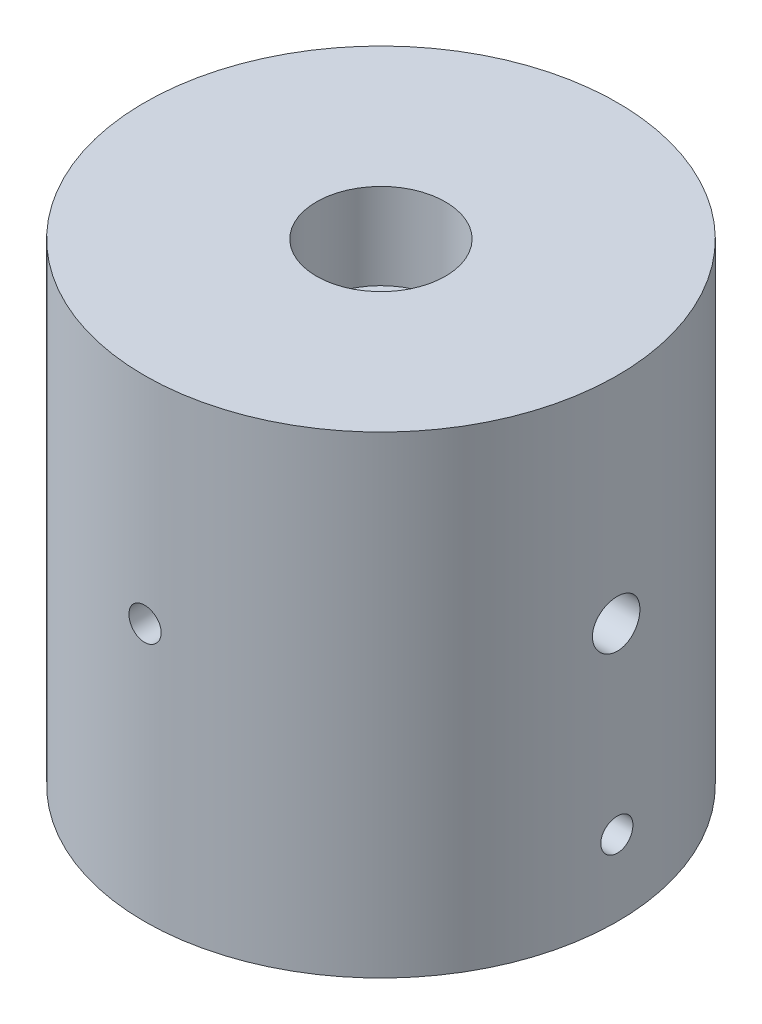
ISO-10303-21;
HEADER;
FILE_DESCRIPTION(('STEP AP214'),'2;1');
FILE_NAME('part.step','',(''),(''),'','','');
FILE_SCHEMA(('AUTOMOTIVE_DESIGN { 1 0 10303 214 1 1 1 1 }'));
ENDSEC;
DATA;
#1=APPLICATION_CONTEXT('core data for automotive mechanical design processes');
#2=APPLICATION_PROTOCOL_DEFINITION('international standard','automotive_design',2000,#1);
#3=PRODUCT_CONTEXT('',#1,'mechanical');
#4=PRODUCT('Part','Part','',(#3));
#5=PRODUCT_RELATED_PRODUCT_CATEGORY('part','',(#4));
#6=PRODUCT_DEFINITION_FORMATION('','',#4);
#7=PRODUCT_DEFINITION_CONTEXT('part definition',#1,'design');
#8=PRODUCT_DEFINITION('design','',#6,#7);
#9=PRODUCT_DEFINITION_SHAPE('','',#8);
#10=(LENGTH_UNIT() NAMED_UNIT(*) SI_UNIT(.MILLI.,.METRE.));
#11=(NAMED_UNIT(*) PLANE_ANGLE_UNIT() SI_UNIT($,.RADIAN.));
#12=(NAMED_UNIT(*) SI_UNIT($,.STERADIAN.) SOLID_ANGLE_UNIT());
#13=UNCERTAINTY_MEASURE_WITH_UNIT(LENGTH_MEASURE(1.E-05),#10,'distance_accuracy_value','');
#14=(GEOMETRIC_REPRESENTATION_CONTEXT(3) GLOBAL_UNCERTAINTY_ASSIGNED_CONTEXT((#13)) GLOBAL_UNIT_ASSIGNED_CONTEXT((#10,
#11,#12)) REPRESENTATION_CONTEXT('',''));
#15=CARTESIAN_POINT('',(0.,0.,0.));
#16=DIRECTION('',(0.,0.,1.));
#17=DIRECTION('',(1.,0.,0.));
#18=AXIS2_PLACEMENT_3D('',#15,#16,#17);
#19=CARTESIAN_POINT('',(0.,34.925,0.));
#20=DIRECTION('',(0.,1.,0.));
#21=DIRECTION('',(0.,0.,1.));
#22=AXIS2_PLACEMENT_3D('',#19,#20,#21);
#23=PLANE('',#22);
#24=CARTESIAN_POINT('',(0.,34.925,0.));
#25=DIRECTION('',(0.,1.,0.));
#26=DIRECTION('',(0.,0.,1.));
#27=AXIS2_PLACEMENT_3D('',#24,#25,#26);
#28=CIRCLE('',#27,4.7625);
#29=CARTESIAN_POINT('',(0.,34.925,4.7625));
#30=VERTEX_POINT('',#29);
#31=EDGE_CURVE('E119',#30,#30,#28,.T.);
#32=ORIENTED_EDGE('',*,*,#31,.F.);
#33=EDGE_LOOP('',(#32));
#34=FACE_BOUND('',#33,.T.);
#35=CARTESIAN_POINT('',(0.,34.925,0.));
#36=DIRECTION('',(0.,1.,0.));
#37=DIRECTION('',(0.,0.,1.));
#38=AXIS2_PLACEMENT_3D('',#35,#36,#37);
#39=CIRCLE('',#38,17.4625);
#40=CARTESIAN_POINT('',(0.,34.925,17.4625));
#41=VERTEX_POINT('',#40);
#42=EDGE_CURVE('E40',#41,#41,#39,.T.);
#43=ORIENTED_EDGE('',*,*,#42,.T.);
#44=EDGE_LOOP('',(#43));
#45=FACE_BOUND('',#44,.T.);
#46=ADVANCED_FACE('F31',(#34,#45),#23,.T.);
#47=CARTESIAN_POINT('',(0.,0.,0.));
#48=DIRECTION('',(0.,1.,0.));
#49=DIRECTION('',(0.,0.,1.));
#50=AXIS2_PLACEMENT_3D('',#47,#48,#49);
#51=PLANE('',#50);
#52=CARTESIAN_POINT('',(0.,0.,0.));
#53=DIRECTION('',(0.,1.,0.));
#54=DIRECTION('',(0.,0.,1.));
#55=AXIS2_PLACEMENT_3D('',#52,#53,#54);
#56=CIRCLE('',#55,17.4625);
#57=CARTESIAN_POINT('',(0.,0.,17.4625));
#58=VERTEX_POINT('',#57);
#59=EDGE_CURVE('E45',#58,#58,#56,.T.);
#60=ORIENTED_EDGE('',*,*,#59,.F.);
#61=EDGE_LOOP('',(#60));
#62=FACE_BOUND('',#61,.T.);
#63=CARTESIAN_POINT('',(0.,0.,0.));
#64=DIRECTION('',(0.,1.,0.));
#65=DIRECTION('',(0.,0.,1.));
#66=AXIS2_PLACEMENT_3D('',#63,#64,#65);
#67=CIRCLE('',#66,3.175);
#68=CARTESIAN_POINT('',(0.,0.,3.175));
#69=VERTEX_POINT('',#68);
#70=EDGE_CURVE('E90',#69,#69,#67,.T.);
#71=ORIENTED_EDGE('',*,*,#70,.T.);
#72=EDGE_LOOP('',(#71));
#73=FACE_BOUND('',#72,.T.);
#74=ADVANCED_FACE('F97',(#62,#73),#51,.F.);
#75=CARTESIAN_POINT('',(0.,34.925,0.));
#76=DIRECTION('',(0.,-1.,0.));
#77=DIRECTION('',(0.,0.,-1.));
#78=AXIS2_PLACEMENT_3D('',#75,#76,#77);
#79=CYLINDRICAL_SURFACE('',#78,17.4625);
#80=CARTESIAN_POINT('',(0.,20.23999,-17.4625));
#81=CARTESIAN_POINT('',(-0.0667591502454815,20.2399870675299,-17.4624994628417));
#82=CARTESIAN_POINT('',(-0.133564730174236,20.23435327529,-17.4621130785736));
#83=CARTESIAN_POINT('',(-0.26533033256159,20.2119603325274,-17.460608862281));
#84=CARTESIAN_POINT('',(-0.330288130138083,20.1951883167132,-17.4594901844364));
#85=CARTESIAN_POINT('',(-0.456430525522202,20.151003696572,-17.4566479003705));
#86=CARTESIAN_POINT('',(-0.517617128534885,20.1235968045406,-17.4549246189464));
#87=CARTESIAN_POINT('',(-0.634505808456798,20.0589299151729,-17.4510668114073));
#88=CARTESIAN_POINT('',(-0.690209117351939,20.0216721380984,-17.4489323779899));
#89=CARTESIAN_POINT('',(-0.794663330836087,19.9382898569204,-17.4444879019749));
#90=CARTESIAN_POINT('',(-0.843403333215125,19.892151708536,-17.4421775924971));
#91=CARTESIAN_POINT('',(-0.932454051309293,19.7923467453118,-17.4376440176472));
#92=CARTESIAN_POINT('',(-0.972764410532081,19.7386796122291,-17.4354207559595));
#93=CARTESIAN_POINT('',(-1.04384626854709,19.625276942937,-17.4313098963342));
#94=CARTESIAN_POINT('',(-1.0746085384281,19.5655356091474,-17.4294226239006));
#95=CARTESIAN_POINT('',(-1.1256619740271,19.4417209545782,-17.4262000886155));
#96=CARTESIAN_POINT('',(-1.14595326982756,19.377647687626,-17.4248648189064));
#97=CARTESIAN_POINT('',(-1.17545804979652,19.2470944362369,-17.422899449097));
#98=CARTESIAN_POINT('',(-1.18468884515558,19.180618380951,-17.4222682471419));
#99=CARTESIAN_POINT('',(-1.19186404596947,19.047057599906,-17.4217788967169));
#100=CARTESIAN_POINT('',(-1.18980859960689,18.9799728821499,-17.4219207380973));
#101=CARTESIAN_POINT('',(-1.17448401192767,18.8472171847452,-17.4229604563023));
#102=CARTESIAN_POINT('',(-1.16123362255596,18.781544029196,-17.4238570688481));
#103=CARTESIAN_POINT('',(-1.12392437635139,18.6533561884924,-17.4263033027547));
#104=CARTESIAN_POINT('',(-1.09986544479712,18.5908415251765,-17.4278529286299));
#105=CARTESIAN_POINT('',(-1.04160084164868,18.4706851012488,-17.4314320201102));
#106=CARTESIAN_POINT('',(-1.00738668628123,18.4130474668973,-17.4334618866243));
#107=CARTESIAN_POINT('',(-0.929788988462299,18.304326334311,-17.4377723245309));
#108=CARTESIAN_POINT('',(-0.886405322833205,18.2532429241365,-17.4400528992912));
#109=CARTESIAN_POINT('',(-0.791594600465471,18.1589712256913,-17.4446133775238));
#110=CARTESIAN_POINT('',(-0.74015131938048,18.1157992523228,-17.4468932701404));
#111=CARTESIAN_POINT('',(-0.630738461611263,18.0387018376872,-17.4511910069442));
#112=CARTESIAN_POINT('',(-0.572768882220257,18.0047764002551,-17.4532088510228));
#113=CARTESIAN_POINT('',(-0.451938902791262,17.94713636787,-17.4567553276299));
#114=CARTESIAN_POINT('',(-0.389078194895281,17.9234224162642,-17.4582839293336));
#115=CARTESIAN_POINT('',(-0.260254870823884,17.886889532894,-17.460679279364));
#116=CARTESIAN_POINT('',(-0.194292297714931,17.8740704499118,-17.461546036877));
#117=CARTESIAN_POINT('',(-0.0612791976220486,17.8597114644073,-17.4625188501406));
#118=CARTESIAN_POINT('',(0.00576888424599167,17.8581490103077,-17.4626264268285));
#119=CARTESIAN_POINT('',(0.139174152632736,17.8662886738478,-17.4620728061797));
#120=CARTESIAN_POINT('',(0.205531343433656,17.8759907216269,-17.4614116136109));
#121=CARTESIAN_POINT('',(0.335607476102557,17.9063653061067,-17.4593958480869));
#122=CARTESIAN_POINT('',(0.399328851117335,17.9270274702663,-17.4580419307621));
#123=CARTESIAN_POINT('',(0.522399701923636,17.978725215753,-17.4547929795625));
#124=CARTESIAN_POINT('',(0.581749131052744,18.0097609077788,-17.4528979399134));
#125=CARTESIAN_POINT('',(0.69449449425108,18.0813819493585,-17.4487757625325));
#126=CARTESIAN_POINT('',(0.747880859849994,18.1219823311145,-17.4465481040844));
#127=CARTESIAN_POINT('',(0.847088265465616,18.2115584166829,-17.4420130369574));
#128=CARTESIAN_POINT('',(0.892909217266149,18.2605342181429,-17.439705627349));
#129=CARTESIAN_POINT('',(0.975761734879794,18.3655683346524,-17.435266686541));
#130=CARTESIAN_POINT('',(1.01277864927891,18.4216382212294,-17.433135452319));
#131=CARTESIAN_POINT('',(1.07687204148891,18.5392108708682,-17.4292939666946));
#132=CARTESIAN_POINT('',(1.10394858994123,18.6007135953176,-17.4275837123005));
#133=CARTESIAN_POINT('',(1.14736737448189,18.7273529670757,-17.4247792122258));
#134=CARTESIAN_POINT('',(1.16371877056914,18.7924864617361,-17.4236844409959));
#135=CARTESIAN_POINT('',(1.18525298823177,18.9245821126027,-17.4222329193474));
#136=CARTESIAN_POINT('',(1.19043594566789,18.991544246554,-17.4218761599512));
#137=CARTESIAN_POINT('',(1.1894847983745,19.1252507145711,-17.4219411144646));
#138=CARTESIAN_POINT('',(1.18337372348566,19.191995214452,-17.4223612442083));
#139=CARTESIAN_POINT('',(1.16005579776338,19.3235079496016,-17.4239292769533));
#140=CARTESIAN_POINT('',(1.14284892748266,19.3882761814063,-17.4250771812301));
#141=CARTESIAN_POINT('',(1.09783321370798,19.5140007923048,-17.4279710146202));
#142=CARTESIAN_POINT('',(1.07002455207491,19.5749572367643,-17.4297169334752));
#143=CARTESIAN_POINT('',(1.00459760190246,19.6913393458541,-17.433610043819));
#144=CARTESIAN_POINT('',(0.966979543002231,19.7467651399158,-17.4357572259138));
#145=CARTESIAN_POINT('',(0.882915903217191,19.8506298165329,-17.4402160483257));
#146=CARTESIAN_POINT('',(0.836453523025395,19.8990550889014,-17.4425279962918));
#147=CARTESIAN_POINT('',(0.73604557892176,19.9874362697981,-17.4470531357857));
#148=CARTESIAN_POINT('',(0.682098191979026,20.0273901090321,-17.4492663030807));
#149=CARTESIAN_POINT('',(0.568180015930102,20.0977294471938,-17.4533472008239));
#150=CARTESIAN_POINT('',(0.508200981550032,20.1281016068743,-17.455214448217));
#151=CARTESIAN_POINT('',(0.384024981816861,20.1783067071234,-17.4583868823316));
#152=CARTESIAN_POINT('',(0.319833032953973,20.1981519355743,-17.4596927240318));
#153=CARTESIAN_POINT('',(0.212709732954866,20.2216070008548,-17.4612546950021));
#154=CARTESIAN_POINT('',(0.170470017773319,20.2284916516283,-17.461719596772));
#155=CARTESIAN_POINT('',(0.0854932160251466,20.2376840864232,-17.4623424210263));
#156=CARTESIAN_POINT('',(0.0427561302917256,20.2399918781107,-17.4625003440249));
#157=CARTESIAN_POINT('',(0.,20.23999,-17.4625));
#158=B_SPLINE_CURVE_WITH_KNOTS('',3,(#80,#81,#82,#83,#84,#85,#86,#87,#88,#89,#90,#91,#92,#93,
#94,#95,#96,#97,#98,#99,#100,#101,#102,#103,#104,#105,#106,#107,#108,#109,#110,#111,#112,#113,
#114,#115,#116,#117,#118,#119,#120,#121,#122,#123,#124,#125,#126,#127,#128,#129,#130,#131,#132,
#133,#134,#135,#136,#137,#138,#139,#140,#141,#142,#143,#144,#145,#146,#147,#148,#149,#150,#151,
#152,#153,#154,#155,#156,#157),.UNSPECIFIED.,.T.,.F.,(4,2,2,2,2,2,2,2,2,2,2,2,2,2,2,2,2,2,2,2,2,
2,2,2,2,2,2,2,2,2,2,2,2,2,2,2,2,2,4),(0.,0.200121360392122,0.400474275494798,0.600719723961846,
0.800920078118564,1.00143052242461,1.20194944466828,1.40266158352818,1.60337122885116,
1.80376632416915,2.00415878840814,2.20421625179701,2.40427509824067,2.6045015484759,
2.80473068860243,3.00536820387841,3.20600580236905,3.40665603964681,3.60730349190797,
3.80754885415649,4.00779297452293,4.20784792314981,4.40790500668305,4.60827862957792,
4.80865458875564,5.00936171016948,5.21006740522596,5.41060146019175,5.61113307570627,
5.81125623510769,6.01137974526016,6.2114998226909,6.41161521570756,6.61211457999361,
6.81266286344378,7.01348912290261,7.21408044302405,7.34224907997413,7.47041750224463),.UNSPECIFIED.);
#159=CARTESIAN_POINT('',(0.,20.23999,-17.4625));
#160=VERTEX_POINT('',#159);
#161=EDGE_CURVE('E138',#160,#160,#158,.T.);
#162=ORIENTED_EDGE('',*,*,#161,.T.);
#163=EDGE_LOOP('',(#162));
#164=FACE_BOUND('',#163,.T.);
#165=CARTESIAN_POINT('',(1.18999,19.05,17.421906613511));
#166=CARTESIAN_POINT('',(1.18998706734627,18.9832410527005,17.4219071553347));
#167=CARTESIAN_POINT('',(1.18435330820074,18.9164356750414,17.4222944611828));
#168=CARTESIAN_POINT('',(1.16196050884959,18.7846704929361,17.4238019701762));
#169=CARTESIAN_POINT('',(1.14518860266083,18.7197129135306,17.4249230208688));
#170=CARTESIAN_POINT('',(1.10100430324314,18.5935709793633,17.4277704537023));
#171=CARTESIAN_POINT('',(1.07359762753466,18.5323846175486,17.4294965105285));
#172=CARTESIAN_POINT('',(1.00893124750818,18.4154963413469,17.4333590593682));
#173=CARTESIAN_POINT('',(0.971673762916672,18.3597931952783,17.4354954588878));
#174=CARTESIAN_POINT('',(0.888291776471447,18.2553387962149,17.4399422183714));
#175=CARTESIAN_POINT('',(0.842153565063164,18.2065984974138,17.4422528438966));
#176=CARTESIAN_POINT('',(0.742348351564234,18.1175472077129,17.4467852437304));
#177=CARTESIAN_POINT('',(0.688681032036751,18.0772365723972,17.4490070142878));
#178=CARTESIAN_POINT('',(0.575278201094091,18.0061544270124,17.4531137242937));
#179=CARTESIAN_POINT('',(0.51553692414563,17.9753920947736,17.4549983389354));
#180=CARTESIAN_POINT('',(0.391722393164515,17.9243385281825,17.4582155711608));
#181=CARTESIAN_POINT('',(0.327649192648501,17.9040471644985,17.4595481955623));
#182=CARTESIAN_POINT('',(0.19709613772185,17.8745422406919,17.4615094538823));
#183=CARTESIAN_POINT('',(0.130620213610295,17.8653113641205,17.4621391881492));
#184=CARTESIAN_POINT('',(-0.00294031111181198,17.8581359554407,17.46262742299));
#185=CARTESIAN_POINT('',(-0.0700249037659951,17.8601912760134,17.4624859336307));
#186=CARTESIAN_POINT('',(-0.202781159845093,17.8755156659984,17.461448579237));
#187=CARTESIAN_POINT('',(-0.268454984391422,17.8887661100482,17.4605539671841));
#188=CARTESIAN_POINT('',(-0.396644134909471,17.926075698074,17.4581125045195));
#189=CARTESIAN_POINT('',(-0.459159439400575,17.9501349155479,17.4565656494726));
#190=CARTESIAN_POINT('',(-0.579316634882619,18.00840010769,17.4529916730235));
#191=CARTESIAN_POINT('',(-0.636954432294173,18.0426144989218,17.4509641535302));
#192=CARTESIAN_POINT('',(-0.745675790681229,18.1202126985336,17.4466569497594));
#193=CARTESIAN_POINT('',(-0.796759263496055,18.1635966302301,17.4443772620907));
#194=CARTESIAN_POINT('',(-0.891030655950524,18.2584075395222,17.4398167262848));
#195=CARTESIAN_POINT('',(-0.934202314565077,18.3098506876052,17.4375358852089));
#196=CARTESIAN_POINT('',(-1.01129915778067,18.4192631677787,17.4332348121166));
#197=CARTESIAN_POINT('',(-1.04522433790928,18.4772325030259,17.4312145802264));
#198=CARTESIAN_POINT('',(-1.10286418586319,18.5980624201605,17.4276629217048));
#199=CARTESIAN_POINT('',(-1.12657813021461,18.6609233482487,17.4261315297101));
#200=CARTESIAN_POINT('',(-1.16311093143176,18.7897471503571,17.4237314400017));
#201=CARTESIAN_POINT('',(-1.17592994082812,18.8557099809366,17.4228627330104));
#202=CARTESIAN_POINT('',(-1.19028864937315,18.9887231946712,17.4218877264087));
#203=CARTESIAN_POINT('',(-1.19185096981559,19.0557711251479,17.4217798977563));
#204=CARTESIAN_POINT('',(-1.18371109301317,19.1891760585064,17.4223348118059));
#205=CARTESIAN_POINT('',(-1.17400896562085,19.2555330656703,17.4229975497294));
#206=CARTESIAN_POINT('',(-1.1436344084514,19.3856083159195,17.4250175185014));
#207=CARTESIAN_POINT('',(-1.12297243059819,19.4493290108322,17.4263740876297));
#208=CARTESIAN_POINT('',(-1.07127528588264,19.5723985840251,17.4296282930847));
#209=CARTESIAN_POINT('',(-1.04024000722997,19.6317474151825,17.4315259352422));
#210=CARTESIAN_POINT('',(-0.968619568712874,19.7444923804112,17.4356521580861));
#211=CARTESIAN_POINT('',(-0.928019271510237,19.7978788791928,17.4378812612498));
#212=CARTESIAN_POINT('',(-0.838443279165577,19.8970865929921,17.4424174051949));
#213=CARTESIAN_POINT('',(-0.789467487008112,19.9429077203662,17.4447244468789));
#214=CARTESIAN_POINT('',(-0.6844332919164,20.0257606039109,17.449160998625));
#215=CARTESIAN_POINT('',(-0.628363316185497,20.0627777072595,17.4512902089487));
#216=CARTESIAN_POINT('',(-0.510790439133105,20.126871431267,17.4551268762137));
#217=CARTESIAN_POINT('',(-0.44928757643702,20.1539481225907,17.4568343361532));
#218=CARTESIAN_POINT('',(-0.322648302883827,20.1973670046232,17.4596336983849));
#219=CARTESIAN_POINT('',(-0.257515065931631,20.2137184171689,17.4607261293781));
#220=CARTESIAN_POINT('',(-0.125419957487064,20.2352527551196,17.462174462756));
#221=CARTESIAN_POINT('',(-0.0584581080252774,20.2404358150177,17.4625303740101));
#222=CARTESIAN_POINT('',(0.0752485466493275,20.2394849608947,17.4624655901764));
#223=CARTESIAN_POINT('',(0.141993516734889,20.2333739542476,17.4620464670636));
#224=CARTESIAN_POINT('',(0.273507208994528,20.2100559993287,17.460481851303));
#225=CARTESIAN_POINT('',(0.338275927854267,20.1928490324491,17.459336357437));
#226=CARTESIAN_POINT('',(0.464001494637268,20.1478329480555,17.4564476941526));
#227=CARTESIAN_POINT('',(0.52495840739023,20.1200240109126,17.4547045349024));
#228=CARTESIAN_POINT('',(0.641341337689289,20.0545963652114,17.4508160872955));
#229=CARTESIAN_POINT('',(0.696767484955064,20.0169778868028,17.4486708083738));
#230=CARTESIAN_POINT('',(0.80063212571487,19.9329137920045,17.4442141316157));
#231=CARTESIAN_POINT('',(0.849057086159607,19.8864514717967,17.4419024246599));
#232=CARTESIAN_POINT('',(0.937437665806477,19.7860437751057,17.4373759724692));
#233=CARTESIAN_POINT('',(0.977391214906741,19.7320965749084,17.4351612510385));
#234=CARTESIAN_POINT('',(1.04773024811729,19.6181785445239,17.4310761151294));
#235=CARTESIAN_POINT('',(1.07810233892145,19.5581994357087,17.4292061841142));
#236=CARTESIAN_POINT('',(1.12830728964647,19.4340232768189,17.4260284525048));
#237=CARTESIAN_POINT('',(1.14815243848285,19.3698312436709,17.4247199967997));
#238=CARTESIAN_POINT('',(1.17160727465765,19.2627081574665,17.4231547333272));
#239=CARTESIAN_POINT('',(1.17849182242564,19.220468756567,17.4226887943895));
#240=CARTESIAN_POINT('',(1.18768412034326,19.1354925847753,17.4220645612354));
#241=CARTESIAN_POINT('',(1.18999187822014,19.0927558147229,17.4219062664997));
#242=CARTESIAN_POINT('',(1.18999,19.05,17.421906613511));
#243=B_SPLINE_CURVE_WITH_KNOTS('',3,(#165,#166,#167,#168,#169,#170,#171,#172,#173,#174,#175,
#176,#177,#178,#179,#180,#181,#182,#183,#184,#185,#186,#187,#188,#189,#190,#191,#192,#193,#194,
#195,#196,#197,#198,#199,#200,#201,#202,#203,#204,#205,#206,#207,#208,#209,#210,#211,#212,#213,
#214,#215,#216,#217,#218,#219,#220,#221,#222,#223,#224,#225,#226,#227,#228,#229,#230,#231,#232,
#233,#234,#235,#236,#237,#238,#239,#240,#241,#242),.UNSPECIFIED.,.T.,.F.,(4,2,2,2,2,2,2,2,2,2,2,
2,2,2,2,2,2,2,2,2,2,2,2,2,2,2,2,2,2,2,2,2,2,2,2,2,2,2,4),(0.,0.200120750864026,0.40047306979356,
0.600717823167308,0.800917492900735,1.0014287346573,1.20194843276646,1.40266027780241,
1.60336964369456,1.80376436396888,2.0041564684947,2.20421583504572,2.40427656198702,
2.60450356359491,2.80473325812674,3.00536997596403,3.20600679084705,3.40665781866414,
3.607306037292,3.80755092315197,4.00779456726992,4.20784759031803,4.40790276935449,
4.60827670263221,4.8086529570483,5.00936040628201,5.21006642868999,5.41059965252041,
5.6111304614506,5.81125498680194,6.01137984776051,6.21150130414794,6.41161806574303,
6.61211661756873,6.8126641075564,7.01349070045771,7.21408233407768,7.34225002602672,
7.4704175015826),.UNSPECIFIED.);
#244=CARTESIAN_POINT('',(1.18999,19.05,17.421906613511));
#245=VERTEX_POINT('',#244);
#246=EDGE_CURVE('E132',#245,#245,#243,.T.);
#247=ORIENTED_EDGE('',*,*,#246,.T.);
#248=EDGE_LOOP('',(#247));
#249=FACE_BOUND('',#248,.T.);
#250=CARTESIAN_POINT('',(-17.3743287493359,19.05,1.75259999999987));
#251=CARTESIAN_POINT('',(-17.3743299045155,18.9518220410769,1.75259574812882));
#252=CARTESIAN_POINT('',(-17.3751698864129,18.8535792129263,1.74432254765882));
#253=CARTESIAN_POINT('',(-17.3784385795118,18.6598175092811,1.7114441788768));
#254=CARTESIAN_POINT('',(-17.3808690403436,18.5643017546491,1.6868210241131));
#255=CARTESIAN_POINT('',(-17.3870406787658,18.3788282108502,1.62196708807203));
#256=CARTESIAN_POINT('',(-17.3907810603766,18.2888670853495,1.58174578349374));
#257=CARTESIAN_POINT('',(-17.3991501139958,18.1169920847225,1.4868555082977));
#258=CARTESIAN_POINT('',(-17.40377860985,18.0350766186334,1.43218940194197));
#259=CARTESIAN_POINT('',(-17.4134213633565,17.8812988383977,1.30974622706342));
#260=CARTESIAN_POINT('',(-17.4184368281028,17.8094701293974,1.24192704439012));
#261=CARTESIAN_POINT('',(-17.4282774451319,17.6781941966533,1.09519284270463));
#262=CARTESIAN_POINT('',(-17.4331025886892,17.6187475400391,1.01627731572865));
#263=CARTESIAN_POINT('',(-17.4420308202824,17.5138070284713,0.849384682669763));
#264=CARTESIAN_POINT('',(-17.4461323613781,17.4683429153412,0.7613887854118));
#265=CARTESIAN_POINT('',(-17.4531381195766,17.3928483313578,0.578963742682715));
#266=CARTESIAN_POINT('',(-17.4560423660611,17.3628174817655,0.484534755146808));
#267=CARTESIAN_POINT('',(-17.4603178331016,17.3191404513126,0.292263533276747));
#268=CARTESIAN_POINT('',(-17.4616942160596,17.3054390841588,0.194433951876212));
#269=CARTESIAN_POINT('',(-17.4627764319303,17.2946391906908,-0.00214521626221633));
#270=CARTESIAN_POINT('',(-17.4624823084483,17.2975402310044,-0.100894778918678));
#271=CARTESIAN_POINT('',(-17.4602608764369,17.319818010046,-0.296136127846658));
#272=CARTESIAN_POINT('',(-17.458339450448,17.3391354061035,-0.392634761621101));
#273=CARTESIAN_POINT('',(-17.4530861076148,17.3936050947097,-0.581013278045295));
#274=CARTESIAN_POINT('',(-17.4497541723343,17.4287575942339,-0.672893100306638));
#275=CARTESIAN_POINT('',(-17.4420442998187,17.5139646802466,-0.849612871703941));
#276=CARTESIAN_POINT('',(-17.4376645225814,17.5640455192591,-0.934440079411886));
#277=CARTESIAN_POINT('',(-17.4283503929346,17.6776686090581,-1.09450765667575));
#278=CARTESIAN_POINT('',(-17.4234160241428,17.7412112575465,-1.1697477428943));
#279=CARTESIAN_POINT('',(-17.4135207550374,17.8802879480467,-1.30885287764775));
#280=CARTESIAN_POINT('',(-17.4085598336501,17.9558736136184,-1.37266632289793));
#281=CARTESIAN_POINT('',(-17.3991922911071,18.1167117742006,-1.48670721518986));
#282=CARTESIAN_POINT('',(-17.3947856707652,18.2019642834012,-1.5369346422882));
#283=CARTESIAN_POINT('',(-17.3870252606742,18.3797558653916,-1.62237751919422));
#284=CARTESIAN_POINT('',(-17.3836716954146,18.4722964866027,-1.6575897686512));
#285=CARTESIAN_POINT('',(-17.3784017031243,18.662017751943,-1.71196184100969));
#286=CARTESIAN_POINT('',(-17.3764852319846,18.7591982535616,-1.73112215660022));
#287=CARTESIAN_POINT('',(-17.3743140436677,18.954987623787,-1.7527800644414));
#288=CARTESIAN_POINT('',(-17.3740521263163,19.0535884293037,-1.75534985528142));
#289=CARTESIAN_POINT('',(-17.3752006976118,19.249817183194,-1.74394338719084));
#290=CARTESIAN_POINT('',(-17.3766111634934,19.347445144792,-1.72996735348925));
#291=CARTESIAN_POINT('',(-17.380939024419,19.5387463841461,-1.68592637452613));
#292=CARTESIAN_POINT('',(-17.3838532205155,19.632427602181,-1.65589557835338));
#293=CARTESIAN_POINT('',(-17.3908575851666,19.8134229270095,-1.58063240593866));
#294=CARTESIAN_POINT('',(-17.3949477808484,19.9007368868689,-1.5353996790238));
#295=CARTESIAN_POINT('',(-17.4038607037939,20.0668482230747,-1.43083581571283));
#296=CARTESIAN_POINT('',(-17.4086858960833,20.1456153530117,-1.37145684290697));
#297=CARTESIAN_POINT('',(-17.4185170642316,20.2920903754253,-1.24035459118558));
#298=CARTESIAN_POINT('',(-17.4235230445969,20.3597979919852,-1.16863100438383));
#299=CARTESIAN_POINT('',(-17.4331734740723,20.4824810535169,-1.01456225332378));
#300=CARTESIAN_POINT('',(-17.437816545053,20.5374093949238,-0.932179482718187));
#301=CARTESIAN_POINT('',(-17.4461979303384,20.6326505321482,-0.759316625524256));
#302=CARTESIAN_POINT('',(-17.4499362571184,20.6729635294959,-0.668836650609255));
#303=CARTESIAN_POINT('',(-17.4560807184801,20.7377498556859,-0.482512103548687));
#304=CARTESIAN_POINT('',(-17.4584892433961,20.7622516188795,-0.386677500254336));
#305=CARTESIAN_POINT('',(-17.461712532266,20.7948127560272,-0.192229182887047));
#306=CARTESIAN_POINT('',(-17.4625273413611,20.802872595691,-0.0936155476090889));
#307=CARTESIAN_POINT('',(-17.4624713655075,20.8023145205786,0.103128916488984));
#308=CARTESIAN_POINT('',(-17.4616079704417,20.7937697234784,0.201259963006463));
#309=CARTESIAN_POINT('',(-17.458307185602,20.7603982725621,0.394685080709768));
#310=CARTESIAN_POINT('',(-17.4558697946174,20.7355716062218,0.489979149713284));
#311=CARTESIAN_POINT('',(-17.4496941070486,20.6703614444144,0.675024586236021));
#312=CARTESIAN_POINT('',(-17.4459559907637,20.6299801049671,0.764776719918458));
#313=CARTESIAN_POINT('',(-17.4375955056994,20.5348146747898,0.936240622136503));
#314=CARTESIAN_POINT('',(-17.4329731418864,20.4800306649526,1.01795243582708));
#315=CARTESIAN_POINT('',(-17.423337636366,20.3573409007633,1.1713908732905));
#316=CARTESIAN_POINT('',(-17.418322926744,20.2893807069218,1.24307386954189));
#317=CARTESIAN_POINT('',(-17.4084811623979,20.142375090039,1.37405087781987));
#318=CARTESIAN_POINT('',(-17.4036541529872,20.0633270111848,1.43334191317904));
#319=CARTESIAN_POINT('',(-17.3947210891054,19.8961679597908,1.53797186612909));
#320=CARTESIAN_POINT('',(-17.390616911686,19.8080343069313,1.5832746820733));
#321=CARTESIAN_POINT('',(-17.3836165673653,19.6254258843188,1.65837782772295));
#322=CARTESIAN_POINT('',(-17.3807190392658,19.5309584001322,1.68819563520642));
#323=CARTESIAN_POINT('',(-17.3771904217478,19.3716305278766,1.72405057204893));
#324=CARTESIAN_POINT('',(-17.3761223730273,19.3077885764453,1.73474196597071));
#325=CARTESIAN_POINT('',(-17.3746911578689,19.1793071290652,1.74901806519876));
#326=CARTESIAN_POINT('',(-17.3743279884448,19.1146676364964,1.7526028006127));
#327=CARTESIAN_POINT('',(-17.3743287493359,19.05,1.75259999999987));
#328=B_SPLINE_CURVE_WITH_KNOTS('',3,(#250,#251,#252,#253,#254,#255,#256,#257,#258,#259,#260,
#261,#262,#263,#264,#265,#266,#267,#268,#269,#270,#271,#272,#273,#274,#275,#276,#277,#278,#279,
#280,#281,#282,#283,#284,#285,#286,#287,#288,#289,#290,#291,#292,#293,#294,#295,#296,#297,#298,
#299,#300,#301,#302,#303,#304,#305,#306,#307,#308,#309,#310,#311,#312,#313,#314,#315,#316,#317,
#318,#319,#320,#321,#322,#323,#324,#325,#326,#327),.UNSPECIFIED.,.T.,.F.,(4,2,2,2,2,2,2,2,2,2,2,
2,2,2,2,2,2,2,2,2,2,2,2,2,2,2,2,2,2,2,2,2,2,2,2,2,2,2,4),(0.,0.294297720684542,
0.588919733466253,0.883363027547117,1.1777479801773,1.47309155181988,1.76844864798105,
2.06442971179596,2.36040351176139,2.65537419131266,2.95033717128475,3.24423841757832,
3.5381435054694,3.83256852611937,4.12700224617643,4.4227338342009,4.71846585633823,
5.01426087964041,5.31004682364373,5.60454469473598,5.89903855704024,6.19290849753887,
6.48678521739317,6.78167016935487,7.07656247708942,7.37252510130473,7.66848364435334,
7.96390845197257,8.25932489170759,8.55344342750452,8.84756218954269,9.14164019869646,
9.43571655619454,9.73103487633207,10.026424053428,10.3225693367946,10.6183796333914,
10.8122278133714,11.0060751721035),.UNSPECIFIED.);
#329=CARTESIAN_POINT('',(-17.3743287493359,19.05,1.75259999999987));
#330=VERTEX_POINT('',#329);
#331=EDGE_CURVE('E195',#330,#330,#328,.T.);
#332=ORIENTED_EDGE('',*,*,#331,.T.);
#333=EDGE_LOOP('',(#332));
#334=FACE_BOUND('',#333,.T.);
#335=CARTESIAN_POINT('',(17.3743287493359,19.05,-1.75259999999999));
#336=CARTESIAN_POINT('',(17.3743299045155,18.9518220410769,-1.75259574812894));
#337=CARTESIAN_POINT('',(17.3751698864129,18.8535792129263,-1.74432254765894));
#338=CARTESIAN_POINT('',(17.3784385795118,18.6598175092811,-1.71144417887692));
#339=CARTESIAN_POINT('',(17.3808690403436,18.5643017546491,-1.68682102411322));
#340=CARTESIAN_POINT('',(17.3870406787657,18.3788282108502,-1.62196708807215));
#341=CARTESIAN_POINT('',(17.3907810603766,18.2888670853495,-1.58174578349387));
#342=CARTESIAN_POINT('',(17.3991501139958,18.1169920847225,-1.48685550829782));
#343=CARTESIAN_POINT('',(17.40377860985,18.0350766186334,-1.43218940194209));
#344=CARTESIAN_POINT('',(17.4134213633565,17.8812988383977,-1.30974622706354));
#345=CARTESIAN_POINT('',(17.4184368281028,17.8094701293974,-1.24192704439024));
#346=CARTESIAN_POINT('',(17.4282774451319,17.6781941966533,-1.09519284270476));
#347=CARTESIAN_POINT('',(17.4331025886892,17.6187475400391,-1.01627731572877));
#348=CARTESIAN_POINT('',(17.4420308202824,17.5138070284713,-0.849384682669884));
#349=CARTESIAN_POINT('',(17.4461323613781,17.4683429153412,-0.761388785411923));
#350=CARTESIAN_POINT('',(17.4531381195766,17.3928483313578,-0.578963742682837));
#351=CARTESIAN_POINT('',(17.4560423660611,17.3628174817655,-0.48453475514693));
#352=CARTESIAN_POINT('',(17.4603178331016,17.3191404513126,-0.292263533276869));
#353=CARTESIAN_POINT('',(17.4616942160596,17.3054390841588,-0.194433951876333));
#354=CARTESIAN_POINT('',(17.4627764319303,17.2946391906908,0.00214521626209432));
#355=CARTESIAN_POINT('',(17.4624823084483,17.2975402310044,0.100894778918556));
#356=CARTESIAN_POINT('',(17.4602608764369,17.319818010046,0.296136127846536));
#357=CARTESIAN_POINT('',(17.458339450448,17.3391354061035,0.392634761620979));
#358=CARTESIAN_POINT('',(17.4530861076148,17.3936050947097,0.581013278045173));
#359=CARTESIAN_POINT('',(17.4497541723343,17.4287575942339,0.672893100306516));
#360=CARTESIAN_POINT('',(17.4420442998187,17.5139646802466,0.849612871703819));
#361=CARTESIAN_POINT('',(17.4376645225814,17.5640455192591,0.934440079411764));
#362=CARTESIAN_POINT('',(17.4283503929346,17.6776686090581,1.09450765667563));
#363=CARTESIAN_POINT('',(17.4234160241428,17.7412112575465,1.16974774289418));
#364=CARTESIAN_POINT('',(17.4135207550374,17.8802879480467,1.30885287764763));
#365=CARTESIAN_POINT('',(17.4085598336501,17.9558736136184,1.37266632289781));
#366=CARTESIAN_POINT('',(17.3991922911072,18.1167117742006,1.48670721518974));
#367=CARTESIAN_POINT('',(17.3947856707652,18.2019642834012,1.53693464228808));
#368=CARTESIAN_POINT('',(17.3870252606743,18.3797558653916,1.62237751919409));
#369=CARTESIAN_POINT('',(17.3836716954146,18.4722964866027,1.65758976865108));
#370=CARTESIAN_POINT('',(17.3784017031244,18.662017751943,1.71196184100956));
#371=CARTESIAN_POINT('',(17.3764852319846,18.7591982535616,1.7311221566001));
#372=CARTESIAN_POINT('',(17.3743140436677,18.954987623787,1.75278006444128));
#373=CARTESIAN_POINT('',(17.3740521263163,19.0535884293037,1.7553498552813));
#374=CARTESIAN_POINT('',(17.3752006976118,19.249817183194,1.74394338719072));
#375=CARTESIAN_POINT('',(17.3766111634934,19.347445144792,1.72996735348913));
#376=CARTESIAN_POINT('',(17.380939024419,19.5387463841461,1.68592637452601));
#377=CARTESIAN_POINT('',(17.3838532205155,19.632427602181,1.65589557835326));
#378=CARTESIAN_POINT('',(17.3908575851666,19.8134229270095,1.58063240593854));
#379=CARTESIAN_POINT('',(17.3949477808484,19.9007368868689,1.53539967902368));
#380=CARTESIAN_POINT('',(17.4038607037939,20.0668482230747,1.43083581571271));
#381=CARTESIAN_POINT('',(17.4086858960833,20.1456153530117,1.37145684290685));
#382=CARTESIAN_POINT('',(17.4185170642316,20.2920903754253,1.24035459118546));
#383=CARTESIAN_POINT('',(17.4235230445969,20.3597979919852,1.1686310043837));
#384=CARTESIAN_POINT('',(17.4331734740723,20.4824810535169,1.01456225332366));
#385=CARTESIAN_POINT('',(17.437816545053,20.5374093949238,0.932179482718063));
#386=CARTESIAN_POINT('',(17.4461979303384,20.6326505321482,0.759316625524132));
#387=CARTESIAN_POINT('',(17.4499362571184,20.6729635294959,0.668836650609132));
#388=CARTESIAN_POINT('',(17.4560807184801,20.7377498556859,0.482512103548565));
#389=CARTESIAN_POINT('',(17.4584892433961,20.7622516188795,0.386677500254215));
#390=CARTESIAN_POINT('',(17.461712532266,20.7948127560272,0.192229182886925));
#391=CARTESIAN_POINT('',(17.4625273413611,20.802872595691,0.0936155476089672));
#392=CARTESIAN_POINT('',(17.4624713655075,20.8023145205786,-0.103128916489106));
#393=CARTESIAN_POINT('',(17.4616079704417,20.7937697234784,-0.201259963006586));
#394=CARTESIAN_POINT('',(17.458307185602,20.7603982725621,-0.394685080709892));
#395=CARTESIAN_POINT('',(17.4558697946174,20.7355716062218,-0.489979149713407));
#396=CARTESIAN_POINT('',(17.4496941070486,20.6703614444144,-0.675024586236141));
#397=CARTESIAN_POINT('',(17.4459559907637,20.6299801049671,-0.764776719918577));
#398=CARTESIAN_POINT('',(17.4375955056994,20.5348146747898,-0.936240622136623));
#399=CARTESIAN_POINT('',(17.4329731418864,20.4800306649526,-1.0179524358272));
#400=CARTESIAN_POINT('',(17.423337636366,20.3573409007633,-1.17139087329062));
#401=CARTESIAN_POINT('',(17.418322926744,20.2893807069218,-1.24307386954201));
#402=CARTESIAN_POINT('',(17.4084811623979,20.142375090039,-1.37405087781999));
#403=CARTESIAN_POINT('',(17.4036541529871,20.0633270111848,-1.43334191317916));
#404=CARTESIAN_POINT('',(17.3947210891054,19.8961679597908,-1.53797186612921));
#405=CARTESIAN_POINT('',(17.390616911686,19.8080343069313,-1.58327468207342));
#406=CARTESIAN_POINT('',(17.3836165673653,19.6254258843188,-1.65837782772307));
#407=CARTESIAN_POINT('',(17.3807190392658,19.5309584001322,-1.68819563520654));
#408=CARTESIAN_POINT('',(17.3771904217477,19.3716305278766,-1.72405057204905));
#409=CARTESIAN_POINT('',(17.3761223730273,19.3077885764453,-1.73474196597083));
#410=CARTESIAN_POINT('',(17.3746911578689,19.1793071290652,-1.74901806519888));
#411=CARTESIAN_POINT('',(17.3743279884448,19.1146676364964,-1.75260280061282));
#412=CARTESIAN_POINT('',(17.3743287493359,19.05,-1.75259999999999));
#413=B_SPLINE_CURVE_WITH_KNOTS('',3,(#335,#336,#337,#338,#339,#340,#341,#342,#343,#344,#345,
#346,#347,#348,#349,#350,#351,#352,#353,#354,#355,#356,#357,#358,#359,#360,#361,#362,#363,#364,
#365,#366,#367,#368,#369,#370,#371,#372,#373,#374,#375,#376,#377,#378,#379,#380,#381,#382,#383,
#384,#385,#386,#387,#388,#389,#390,#391,#392,#393,#394,#395,#396,#397,#398,#399,#400,#401,#402,
#403,#404,#405,#406,#407,#408,#409,#410,#411,#412),.UNSPECIFIED.,.T.,.F.,(4,2,2,2,2,2,2,2,2,2,2,
2,2,2,2,2,2,2,2,2,2,2,2,2,2,2,2,2,2,2,2,2,2,2,2,2,2,2,4),(0.,0.294297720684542,
0.588919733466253,0.883363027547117,1.1777479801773,1.47309155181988,1.76844864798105,
2.06442971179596,2.36040351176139,2.65537419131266,2.95033717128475,3.24423841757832,
3.5381435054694,3.83256852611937,4.12700224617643,4.4227338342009,4.71846585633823,
5.01426087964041,5.31004682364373,5.60454469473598,5.89903855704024,6.19290849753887,
6.48678521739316,6.78167016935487,7.07656247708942,7.37252510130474,7.66848364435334,
7.96390845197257,8.25932489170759,8.55344342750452,8.8475621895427,9.14164019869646,
9.43571655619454,9.73103487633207,10.026424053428,10.3225693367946,10.6183796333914,
10.8122278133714,11.0060751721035),.UNSPECIFIED.);
#414=CARTESIAN_POINT('',(17.3743287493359,19.05,-1.75259999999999));
#415=VERTEX_POINT('',#414);
#416=EDGE_CURVE('E186',#415,#415,#413,.T.);
#417=ORIENTED_EDGE('',*,*,#416,.T.);
#418=EDGE_LOOP('',(#417));
#419=FACE_BOUND('',#418,.T.);
#420=CARTESIAN_POINT('',(-17.4625,4.37515000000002,0.));
#421=CARTESIAN_POINT('',(-17.4624994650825,4.37515292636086,-0.066617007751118));
#422=CARTESIAN_POINT('',(-17.4621147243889,4.38077475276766,-0.133280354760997));
#423=CARTESIAN_POINT('',(-17.4606169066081,4.40312014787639,-0.264765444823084));
#424=CARTESIAN_POINT('',(-17.4595029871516,4.41985655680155,-0.329584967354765));
#425=CARTESIAN_POINT('',(-17.456672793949,4.46394740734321,-0.455458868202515));
#426=CARTESIAN_POINT('',(-17.4549568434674,4.4912961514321,-0.516515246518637));
#427=CARTESIAN_POINT('',(-17.4511154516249,4.55582587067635,-0.633155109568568));
#428=CARTESIAN_POINT('',(-17.448990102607,4.59300462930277,-0.68873982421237));
#429=CARTESIAN_POINT('',(-17.4445645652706,4.67620982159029,-0.792971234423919));
#430=CARTESIAN_POINT('',(-17.4422641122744,4.72224981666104,-0.84160709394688));
#431=CARTESIAN_POINT('',(-17.4377498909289,4.82184238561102,-0.930467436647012));
#432=CARTESIAN_POINT('',(-17.4355361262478,4.8753952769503,-0.970691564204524));
#433=CARTESIAN_POINT('',(-17.4314428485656,4.98855620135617,-1.0416210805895));
#434=CARTESIAN_POINT('',(-17.429563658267,5.04816999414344,-1.07231730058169));
#435=CARTESIAN_POINT('',(-17.4263549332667,5.17172018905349,-1.12326101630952));
#436=CARTESIAN_POINT('',(-17.4250253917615,5.23565653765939,-1.14350864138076));
#437=CARTESIAN_POINT('',(-17.4230684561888,5.36593114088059,-1.17294989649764));
#438=CARTESIAN_POINT('',(-17.4224399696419,5.43226549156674,-1.18216072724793));
#439=CARTESIAN_POINT('',(-17.4219527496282,5.56554150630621,-1.18932004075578));
#440=CARTESIAN_POINT('',(-17.4220940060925,5.63248316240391,-1.1872686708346));
#441=CARTESIAN_POINT('',(-17.4231293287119,5.76495619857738,-1.17197607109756));
#442=CARTESIAN_POINT('',(-17.4240221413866,5.83048974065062,-1.15875347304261));
#443=CARTESIAN_POINT('',(-17.4264579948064,5.95840501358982,-1.12152266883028));
#444=CARTESIAN_POINT('',(-17.4280010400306,6.02078672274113,-1.09751438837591));
#445=CARTESIAN_POINT('',(-17.4315649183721,6.14068728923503,-1.03937264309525));
#446=CARTESIAN_POINT('',(-17.4335861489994,6.19820204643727,-1.00523074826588));
#447=CARTESIAN_POINT('',(-17.4378782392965,6.3066912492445,-0.927797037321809));
#448=CARTESIAN_POINT('',(-17.4401491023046,6.35766560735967,-0.884505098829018));
#449=CARTESIAN_POINT('',(-17.44469012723,6.45173542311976,-0.789895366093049));
#450=CARTESIAN_POINT('',(-17.4469602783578,6.49481466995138,-0.738561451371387));
#451=CARTESIAN_POINT('',(-17.4512396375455,6.57174629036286,-0.629381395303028));
#452=CARTESIAN_POINT('',(-17.4532488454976,6.60559866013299,-0.571535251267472));
#453=CARTESIAN_POINT('',(-17.4567801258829,6.66311429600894,-0.450962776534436));
#454=CARTESIAN_POINT('',(-17.4583021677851,6.68677692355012,-0.388236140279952));
#455=CARTESIAN_POINT('',(-17.4606872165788,6.72323042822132,-0.259687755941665));
#456=CARTESIAN_POINT('',(-17.4615502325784,6.73602145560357,-0.193866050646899));
#457=CARTESIAN_POINT('',(-17.4625188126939,6.75034852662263,-0.0611365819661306));
#458=CARTESIAN_POINT('',(-17.4626258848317,6.7519069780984,0.00576875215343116));
#459=CARTESIAN_POINT('',(-17.4620745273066,6.7437832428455,0.138889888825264));
#460=CARTESIAN_POINT('',(-17.4614161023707,6.73410112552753,0.20510569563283));
#461=CARTESIAN_POINT('',(-17.4594088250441,6.70378965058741,0.334904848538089));
#462=CARTESIAN_POINT('',(-17.4580606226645,6.68317059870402,0.398490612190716));
#463=CARTESIAN_POINT('',(-17.4548254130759,6.63158103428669,0.521299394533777));
#464=CARTESIAN_POINT('',(-17.4529384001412,6.60061041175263,0.580522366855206));
#465=CARTESIAN_POINT('',(-17.4488337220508,6.52913997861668,0.693026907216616));
#466=CARTESIAN_POINT('',(-17.4466155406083,6.48862523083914,0.746298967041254));
#467=CARTESIAN_POINT('',(-17.4420997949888,6.39923831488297,0.845293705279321));
#468=CARTESIAN_POINT('',(-17.4398022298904,6.35036604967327,0.891016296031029));
#469=CARTESIAN_POINT('',(-17.4353822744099,6.24555459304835,0.973690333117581));
#470=CARTESIAN_POINT('',(-17.4332601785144,6.18960390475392,1.01062722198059));
#471=CARTESIAN_POINT('',(-17.4294351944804,6.0722814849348,1.07458172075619));
#472=CARTESIAN_POINT('',(-17.4277323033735,6.01090979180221,1.10159940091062));
#473=CARTESIAN_POINT('',(-17.4249399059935,5.88454026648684,1.14492343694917));
#474=CARTESIAN_POINT('',(-17.4238498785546,5.81954556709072,1.16123889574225));
#475=CARTESIAN_POINT('',(-17.4224046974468,5.68773162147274,1.18272506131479));
#476=CARTESIAN_POINT('',(-17.4220495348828,5.62091239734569,1.18789590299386));
#477=CARTESIAN_POINT('',(-17.4221143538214,5.48749087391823,1.18694470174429));
#478=CARTESIAN_POINT('',(-17.4225327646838,5.4208884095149,1.18084554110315));
#479=CARTESIAN_POINT('',(-17.4240942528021,5.28965570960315,1.15757497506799));
#480=CARTESIAN_POINT('',(-17.4252373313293,5.22502547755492,1.14040355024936));
#481=CARTESIAN_POINT('',(-17.4281189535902,5.09956891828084,1.09548121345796));
#482=CARTESIAN_POINT('',(-17.4298574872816,5.03874252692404,1.06773047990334));
#483=CARTESIAN_POINT('',(-17.4337340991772,4.92260898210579,1.0024402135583));
#484=CARTESIAN_POINT('',(-17.4358721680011,4.86730169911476,0.964900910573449));
#485=CARTESIAN_POINT('',(-17.4403120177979,4.76365989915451,0.881013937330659));
#486=CARTESIAN_POINT('',(-17.442614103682,4.71533890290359,0.834649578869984));
#487=CARTESIAN_POINT('',(-17.4471199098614,4.62714840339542,0.734453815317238));
#488=CARTESIAN_POINT('',(-17.4493236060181,4.58728096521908,0.68062059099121));
#489=CARTESIAN_POINT('',(-17.4533869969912,4.51709433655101,0.566944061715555));
#490=CARTESIAN_POINT('',(-17.4552462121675,4.48678841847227,0.507092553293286));
#491=CARTESIAN_POINT('',(-17.4584049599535,4.43669335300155,0.383180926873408));
#492=CARTESIAN_POINT('',(-17.4597051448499,4.41689194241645,0.319125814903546));
#493=CARTESIAN_POINT('',(-17.4612602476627,4.39349015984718,0.212235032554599));
#494=CARTESIAN_POINT('',(-17.4617230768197,4.38662155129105,0.170089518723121));
#495=CARTESIAN_POINT('',(-17.4623431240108,4.37745053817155,0.0853023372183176));
#496=CARTESIAN_POINT('',(-17.4625003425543,4.37514812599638,0.042660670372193));
#497=CARTESIAN_POINT('',(-17.4625,4.37515000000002,0.));
#498=B_SPLINE_CURVE_WITH_KNOTS('',3,(#420,#421,#422,#423,#424,#425,#426,#427,#428,#429,#430,
#431,#432,#433,#434,#435,#436,#437,#438,#439,#440,#441,#442,#443,#444,#445,#446,#447,#448,#449,
#450,#451,#452,#453,#454,#455,#456,#457,#458,#459,#460,#461,#462,#463,#464,#465,#466,#467,#468,
#469,#470,#471,#472,#473,#474,#475,#476,#477,#478,#479,#480,#481,#482,#483,#484,#485,#486,#487,
#488,#489,#490,#491,#492,#493,#494,#495,#496,#497),.UNSPECIFIED.,.T.,.F.,(4,2,2,2,2,2,2,2,2,2,2,
2,2,2,2,2,2,2,2,2,2,2,2,2,2,2,2,2,2,2,2,2,2,2,2,2,2,2,4),(0.,0.199695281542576,
0.399621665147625,0.599440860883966,0.79921503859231,0.99929742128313,1.19938826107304,
1.39967105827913,1.59995137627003,1.79991915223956,1.99988431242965,2.19951662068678,
2.39915030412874,2.59895052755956,2.79875342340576,2.99896208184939,3.19917082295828,
3.39939210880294,3.59961062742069,3.79942961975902,3.99924737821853,4.19887718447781,
4.3985091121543,4.59845557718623,4.79840436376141,4.9986821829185,5.19895858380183,
5.39906441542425,5.59916782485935,5.7988653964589,5.99856331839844,6.19825787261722,
6.3979477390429,6.59801904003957,6.79813915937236,6.99853585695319,7.19869808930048,
7.32658057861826,7.45446285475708),.UNSPECIFIED.);
#499=CARTESIAN_POINT('',(-17.4625,4.37515000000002,0.));
#500=VERTEX_POINT('',#499);
#501=EDGE_CURVE('E10',#500,#500,#498,.T.);
#502=ORIENTED_EDGE('',*,*,#501,.T.);
#503=EDGE_LOOP('',(#502));
#504=FACE_BOUND('',#503,.T.);
#505=CARTESIAN_POINT('',(17.4220799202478,5.5626,-1.18744999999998));
#506=CARTESIAN_POINT('',(17.4220804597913,5.49598319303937,-1.18744707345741));
#507=CARTESIAN_POINT('',(17.4224661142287,5.42932004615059,-1.18182527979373));
#508=CARTESIAN_POINT('',(17.4239671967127,5.29783537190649,-1.15948002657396));
#509=CARTESIAN_POINT('',(17.4250834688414,5.23301606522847,-1.14274372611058));
#510=CARTESIAN_POINT('',(17.4279187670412,5.10714262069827,-1.0986531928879));
#511=CARTESIAN_POINT('',(17.4296374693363,5.0460864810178,-1.07130466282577));
#512=CARTESIAN_POINT('',(17.4334835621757,4.92944701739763,-1.00677544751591));
#513=CARTESIAN_POINT('',(17.4356108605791,4.87386246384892,-0.969596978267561));
#514=CARTESIAN_POINT('',(17.4400386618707,4.7696308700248,-0.886392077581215));
#515=CARTESIAN_POINT('',(17.4423394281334,4.72099471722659,-0.840352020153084));
#516=CARTESIAN_POINT('',(17.4468524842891,4.63213380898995,-0.740759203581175));
#517=CARTESIAN_POINT('',(17.4490647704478,4.59190940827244,-0.687206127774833));
#518=CARTESIAN_POINT('',(17.4531539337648,4.52097960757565,-0.574045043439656));
#519=CARTESIAN_POINT('',(17.4550304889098,4.49028332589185,-0.514431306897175));
#520=CARTESIAN_POINT('',(17.458233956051,4.43933948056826,-0.39088123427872));
#521=CARTESIAN_POINT('',(17.4595608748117,4.41909178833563,-0.326944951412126));
#522=CARTESIAN_POINT('',(17.4615137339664,4.38965039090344,-0.196670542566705));
#523=CARTESIAN_POINT('',(17.4621407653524,4.38043947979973,-0.130336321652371));
#524=CARTESIAN_POINT('',(17.4626268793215,4.37327996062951,0.0029394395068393));
#525=CARTESIAN_POINT('',(17.462485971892,4.37533120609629,0.0698809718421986));
#526=CARTESIAN_POINT('',(17.4614529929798,4.39062361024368,0.202354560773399));
#527=CARTESIAN_POINT('',(17.4605621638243,4.40384626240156,0.267888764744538));
#528=CARTESIAN_POINT('',(17.4581310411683,4.44107740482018,0.395805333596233));
#529=CARTESIAN_POINT('',(17.456590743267,4.46508596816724,0.45818767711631));
#530=CARTESIAN_POINT('',(17.4530319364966,4.52322829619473,0.578089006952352));
#531=CARTESIAN_POINT('',(17.4510130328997,4.55737042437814,0.635603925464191));
#532=CARTESIAN_POINT('',(17.4467241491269,4.6348046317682,0.744093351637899));
#533=CARTESIAN_POINT('',(17.4444541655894,4.67809683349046,0.79506777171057));
#534=CARTESIAN_POINT('',(17.4399130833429,4.77270675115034,0.889137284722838));
#535=CARTESIAN_POINT('',(17.4376419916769,4.82404053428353,0.932216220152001));
#536=CARTESIAN_POINT('',(17.4333593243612,4.93322021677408,1.00914727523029));
#537=CARTESIAN_POINT('',(17.4313477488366,4.99106611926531,1.0429993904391));
#538=CARTESIAN_POINT('',(17.4278113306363,5.11163853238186,1.10051484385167));
#539=CARTESIAN_POINT('',(17.4262865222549,5.17436538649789,1.12417746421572));
#540=CARTESIAN_POINT('',(17.4238967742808,5.30291424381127,1.16063088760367));
#541=CARTESIAN_POINT('',(17.4230318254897,5.36873620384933,1.17342184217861));
#542=CARTESIAN_POINT('',(17.4220610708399,5.50146578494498,1.18774863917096));
#543=CARTESIAN_POINT('',(17.4219537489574,5.56837096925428,1.18930695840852));
#544=CARTESIAN_POINT('',(17.4225063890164,5.70149177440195,1.18118301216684));
#545=CARTESIAN_POINT('',(17.4231663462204,5.76770739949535,1.1715008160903));
#546=CARTESIAN_POINT('',(17.4251777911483,5.89750567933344,1.14118936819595));
#547=CARTESIAN_POINT('',(17.4265286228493,5.96109077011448,1.12057050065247));
#548=CARTESIAN_POINT('',(17.4297690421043,6.08389828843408,1.06898153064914));
#549=CARTESIAN_POINT('',(17.4316586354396,6.14312066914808,1.038011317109));
#550=CARTESIAN_POINT('',(17.4357673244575,6.25562481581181,0.966541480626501));
#551=CARTESIAN_POINT('',(17.4379869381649,6.30889700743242,0.926026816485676));
#552=CARTESIAN_POINT('',(17.4425037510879,6.40789205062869,0.836639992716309));
#553=CARTESIAN_POINT('',(17.4448009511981,6.45361481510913,0.787767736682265));
#554=CARTESIAN_POINT('',(17.4492185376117,6.53628921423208,0.682956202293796));
#555=CARTESIAN_POINT('',(17.4513386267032,6.57322629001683,0.627005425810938));
#556=CARTESIAN_POINT('',(17.4551588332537,6.63718111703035,0.50968278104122));
#557=CARTESIAN_POINT('',(17.4568589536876,6.66419893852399,0.448310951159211));
#558=CARTESIAN_POINT('',(17.4596462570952,6.7075230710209,0.321941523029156));
#559=CARTESIAN_POINT('',(17.4607339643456,6.72383854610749,0.256947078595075));
#560=CARTESIAN_POINT('',(17.4621759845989,6.7453248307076,0.125133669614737));
#561=CARTESIAN_POINT('',(17.4625303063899,6.75049577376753,0.0583147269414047));
#562=CARTESIAN_POINT('',(17.4624656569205,6.74954486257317,-0.0751069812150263));
#563=CARTESIAN_POINT('',(17.4620482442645,6.74344576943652,-0.14170991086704));
#564=CARTESIAN_POINT('',(17.4604901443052,6.72017517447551,-0.272943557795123));
#565=CARTESIAN_POINT('',(17.4593494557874,6.70300365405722,-0.33757427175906));
#566=CARTESIAN_POINT('',(17.4564729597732,6.65808095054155,-0.463031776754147));
#567=CARTESIAN_POINT('',(17.4547371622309,6.63032994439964,-0.523858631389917));
#568=CARTESIAN_POINT('',(17.4508651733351,6.56503898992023,-0.63999298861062));
#569=CARTESIAN_POINT('',(17.4487289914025,6.52749927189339,-0.695300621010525));
#570=CARTESIAN_POINT('',(17.4442912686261,6.44361184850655,-0.79894238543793));
#571=CARTESIAN_POINT('',(17.4419894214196,6.3972475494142,-0.847263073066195));
#572=CARTESIAN_POINT('',(17.4374823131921,6.29705203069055,-0.935452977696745));
#573=CARTESIAN_POINT('',(17.435277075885,6.24321899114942,-0.975320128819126));
#574=CARTESIAN_POINT('',(17.4312094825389,6.12954260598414,-1.0455064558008));
#575=CARTESIAN_POINT('',(17.4293476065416,6.06969102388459,-1.07581230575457));
#576=CARTESIAN_POINT('',(17.4261836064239,5.94577923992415,-1.12590722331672));
#577=CARTESIAN_POINT('',(17.4248808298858,5.88172404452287,-1.14570855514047));
#578=CARTESIAN_POINT('',(17.4233224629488,5.77483347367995,-1.16911011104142));
#579=CARTESIAN_POINT('',(17.4228586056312,5.73268827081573,-1.17597861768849));
#580=CARTESIAN_POINT('',(17.4222371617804,5.64790171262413,-1.18514949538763));
#581=CARTESIAN_POINT('',(17.4220795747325,5.60526035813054,-1.18745187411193));
#582=CARTESIAN_POINT('',(17.4220799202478,5.5626,-1.18744999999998));
#583=B_SPLINE_CURVE_WITH_KNOTS('',3,(#505,#506,#507,#508,#509,#510,#511,#512,#513,#514,#515,
#516,#517,#518,#519,#520,#521,#522,#523,#524,#525,#526,#527,#528,#529,#530,#531,#532,#533,#534,
#535,#536,#537,#538,#539,#540,#541,#542,#543,#544,#545,#546,#547,#548,#549,#550,#551,#552,#553,
#554,#555,#556,#557,#558,#559,#560,#561,#562,#563,#564,#565,#566,#567,#568,#569,#570,#571,#572,
#573,#574,#575,#576,#577,#578,#579,#580,#581,#582),.UNSPECIFIED.,.T.,.F.,(4,2,2,2,2,2,2,2,2,2,2,
2,2,2,2,2,2,2,2,2,2,2,2,2,2,2,2,2,2,2,2,2,2,2,2,2,2,2,4),(0.,0.199694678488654,0.39962047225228,
0.599438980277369,0.799212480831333,0.999295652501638,1.19938725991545,1.39966976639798,
1.59994980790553,1.79991721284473,1.99988201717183,2.19951620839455,2.39915175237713,
2.59895252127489,2.79875596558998,2.99896383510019,3.19917180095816,3.39939386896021,
3.59961314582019,3.79943166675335,3.9992489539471,4.19887685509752,4.39850689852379,
4.59845367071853,4.79840274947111,4.99868089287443,5.19895761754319,5.39906262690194,
5.59916523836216,5.79886416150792,5.99856342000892,6.19825933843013,6.39795055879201,
6.59802105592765,6.79814039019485,6.99853741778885,7.19869996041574,7.32658151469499,
7.45446285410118),.UNSPECIFIED.);
#584=CARTESIAN_POINT('',(17.4220799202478,5.5626,-1.18744999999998));
#585=VERTEX_POINT('',#584);
#586=EDGE_CURVE('E52',#585,#585,#583,.T.);
#587=ORIENTED_EDGE('',*,*,#586,.T.);
#588=EDGE_LOOP('',(#587));
#589=FACE_BOUND('',#588,.T.);
#590=ORIENTED_EDGE('',*,*,#42,.F.);
#591=EDGE_LOOP('',(#590));
#592=FACE_BOUND('',#591,.T.);
#593=ORIENTED_EDGE('',*,*,#59,.T.);
#594=EDGE_LOOP('',(#593));
#595=FACE_BOUND('',#594,.T.);
#596=ADVANCED_FACE('F33',(#164,#249,#334,#419,#504,#589,#592,#595),#79,.T.);
#597=CARTESIAN_POINT('',(0.,34.925,0.));
#598=DIRECTION('',(0.,-1.,0.));
#599=DIRECTION('',(0.,0.,-1.));
#600=AXIS2_PLACEMENT_3D('',#597,#598,#599);
#601=CYLINDRICAL_SURFACE('',#600,3.175);
#602=CARTESIAN_POINT('',(0.,22.6533637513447,0.));
#603=DIRECTION('',(0.,1.,0.));
#604=DIRECTION('',(0.,0.,1.));
#605=AXIS2_PLACEMENT_3D('',#602,#603,#604);
#606=CIRCLE('',#605,3.175);
#607=CARTESIAN_POINT('',(0.,22.6533637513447,3.175));
#608=VERTEX_POINT('',#607);
#609=EDGE_CURVE('E36',#608,#608,#606,.F.);
#610=ORIENTED_EDGE('',*,*,#609,.F.);
#611=EDGE_LOOP('',(#610));
#612=FACE_BOUND('',#611,.T.);
#613=CARTESIAN_POINT('',(0.,20.23999,-3.175));
#614=CARTESIAN_POINT('',(-0.0644483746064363,20.2399922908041,-3.17500171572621));
#615=CARTESIAN_POINT('',(-0.12888105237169,20.2347379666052,-3.17302059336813));
#616=CARTESIAN_POINT('',(-0.255820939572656,20.2139444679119,-3.16531549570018));
#617=CARTESIAN_POINT('',(-0.31832842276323,20.1984067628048,-3.15959205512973));
#618=CARTESIAN_POINT('',(-0.439568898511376,20.1576731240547,-3.14501670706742));
#619=CARTESIAN_POINT('',(-0.498308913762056,20.1324958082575,-3.13617083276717));
#620=CARTESIAN_POINT('',(-0.610727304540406,20.0732922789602,-3.11623179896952));
#621=CARTESIAN_POINT('',(-0.664404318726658,20.0392636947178,-3.10513803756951));
#622=CARTESIAN_POINT('',(-0.767450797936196,19.9618153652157,-3.0813225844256));
#623=CARTESIAN_POINT('',(-0.81657695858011,19.918086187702,-3.06855485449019));
#624=CARTESIAN_POINT('',(-0.906994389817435,19.8231348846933,-3.04305719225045));
#625=CARTESIAN_POINT('',(-0.948283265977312,19.7719104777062,-3.0303272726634));
#626=CARTESIAN_POINT('',(-1.02340051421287,19.6610463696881,-3.0058110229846));
#627=CARTESIAN_POINT('',(-1.0568853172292,19.6011606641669,-2.99407901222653));
#628=CARTESIAN_POINT('',(-1.11319968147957,19.4760987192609,-2.97360320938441));
#629=CARTESIAN_POINT('',(-1.13603349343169,19.4109246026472,-2.96485822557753));
#630=CARTESIAN_POINT('',(-1.16943744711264,19.2799363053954,-2.95183882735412));
#631=CARTESIAN_POINT('',(-1.18047186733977,19.2142578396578,-2.947395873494));
#632=CARTESIAN_POINT('',(-1.19141543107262,19.0818427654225,-2.94299041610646));
#633=CARTESIAN_POINT('',(-1.19132916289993,19.0151066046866,-2.94302606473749));
#634=CARTESIAN_POINT('',(-1.18038885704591,18.8867174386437,-2.94742845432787));
#635=CARTESIAN_POINT('',(-1.17017874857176,18.8249990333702,-2.95153618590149));
#636=CARTESIAN_POINT('',(-1.14034504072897,18.7042255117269,-2.96318949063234));
#637=CARTESIAN_POINT('',(-1.1207200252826,18.64517079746,-2.97073558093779));
#638=CARTESIAN_POINT('',(-1.07225961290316,18.5300878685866,-2.98857145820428));
#639=CARTESIAN_POINT('',(-1.04325709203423,18.4741379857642,-2.9989104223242));
#640=CARTESIAN_POINT('',(-0.976981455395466,18.3677121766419,-3.02115072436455));
#641=CARTESIAN_POINT('',(-0.939705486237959,18.3172381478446,-3.03305260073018));
#642=CARTESIAN_POINT('',(-0.854994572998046,18.2196323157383,-3.05805234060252));
#643=CARTESIAN_POINT('',(-0.80704563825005,18.1729523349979,-3.07117685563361));
#644=CARTESIAN_POINT('',(-0.703849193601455,18.088161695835,-3.09645614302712));
#645=CARTESIAN_POINT('',(-0.648600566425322,18.0500523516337,-3.10861076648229));
#646=CARTESIAN_POINT('',(-0.531221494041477,17.9829871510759,-3.13082194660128));
#647=CARTESIAN_POINT('',(-0.468998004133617,17.9541816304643,-3.14084323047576));
#648=CARTESIAN_POINT('',(-0.34011918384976,17.907597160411,-3.15739695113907));
#649=CARTESIAN_POINT('',(-0.273465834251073,17.8898133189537,-3.16393093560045));
#650=CARTESIAN_POINT('',(-0.14142203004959,17.8666453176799,-3.17250188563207));
#651=CARTESIAN_POINT('',(-0.076152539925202,17.8606527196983,-3.17475927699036));
#652=CARTESIAN_POINT('',(0.0544908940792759,17.8594658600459,-3.17520377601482));
#653=CARTESIAN_POINT('',(0.119864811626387,17.8642692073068,-3.17339178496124));
#654=CARTESIAN_POINT('',(0.246233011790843,17.8840753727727,-3.16604652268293));
#655=CARTESIAN_POINT('',(0.307299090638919,17.8986797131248,-3.16065872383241));
#656=CARTESIAN_POINT('',(0.426071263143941,17.9371487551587,-3.14685012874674));
#657=CARTESIAN_POINT('',(0.483776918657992,17.9610146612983,-3.13842893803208));
#658=CARTESIAN_POINT('',(0.596089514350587,18.0180900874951,-3.11907786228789));
#659=CARTESIAN_POINT('',(0.650555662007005,18.051553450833,-3.10808155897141));
#660=CARTESIAN_POINT('',(0.753281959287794,18.1265868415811,-3.08479660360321));
#661=CARTESIAN_POINT('',(0.801539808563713,18.168159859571,-3.07250747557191));
#662=CARTESIAN_POINT('',(0.893405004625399,18.261067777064,-3.0471060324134));
#663=CARTESIAN_POINT('',(0.93658074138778,18.3128287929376,-3.03398728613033));
#664=CARTESIAN_POINT('',(1.01371853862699,18.4231193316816,-3.00909410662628));
#665=CARTESIAN_POINT('',(1.04767977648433,18.4816494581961,-2.99731979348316));
#666=CARTESIAN_POINT('',(1.10545794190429,18.6042978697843,-2.97649791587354));
#667=CARTESIAN_POINT('',(1.12923260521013,18.6684381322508,-2.96746175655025));
#668=CARTESIAN_POINT('',(1.16548820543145,18.8002448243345,-2.95341287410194));
#669=CARTESIAN_POINT('',(1.17797611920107,18.8679090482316,-2.94839766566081));
#670=CARTESIAN_POINT('',(1.19068068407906,19.0001666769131,-2.94328845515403));
#671=CARTESIAN_POINT('',(1.19163322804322,19.0646785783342,-2.94289936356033));
#672=CARTESIAN_POINT('',(1.1831249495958,19.192891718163,-2.94633009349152));
#673=CARTESIAN_POINT('',(1.17366511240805,19.2565930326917,-2.95014951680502));
#674=CARTESIAN_POINT('',(1.14517328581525,19.3794077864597,-2.96132145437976));
#675=CARTESIAN_POINT('',(1.12644158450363,19.4386018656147,-2.96856282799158));
#676=CARTESIAN_POINT('',(1.08020215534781,19.5530416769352,-2.98569811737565));
#677=CARTESIAN_POINT('',(1.05269221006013,19.6082864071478,-2.99559270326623));
#678=CARTESIAN_POINT('',(0.988005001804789,19.7164054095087,-3.01756433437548));
#679=CARTESIAN_POINT('',(0.950396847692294,19.7690039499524,-3.02972854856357));
#680=CARTESIAN_POINT('',(0.867248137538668,19.8673786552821,-3.05456818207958));
#681=CARTESIAN_POINT('',(0.821705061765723,19.9131526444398,-3.06724376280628));
#682=CARTESIAN_POINT('',(0.721037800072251,19.9991003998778,-3.09250065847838));
#683=CARTESIAN_POINT('',(0.665528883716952,20.0388379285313,-3.10503987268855));
#684=CARTESIAN_POINT('',(0.548180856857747,20.1084074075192,-3.12788950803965));
#685=CARTESIAN_POINT('',(0.486341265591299,20.1382386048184,-3.13819975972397));
#686=CARTESIAN_POINT('',(0.355251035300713,20.1879769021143,-3.15578382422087));
#687=CARTESIAN_POINT('',(0.285796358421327,20.2074038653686,-3.1629085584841));
#688=CARTESIAN_POINT('',(0.144220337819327,20.2334059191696,-3.17251452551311));
#689=CARTESIAN_POINT('',(0.0721003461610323,20.2399874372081,-3.17499808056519));
#690=CARTESIAN_POINT('',(0.,20.23999,-3.175));
#691=B_SPLINE_CURVE_WITH_KNOTS('',3,(#613,#614,#615,#616,#617,#618,#619,#620,#621,#622,#623,
#624,#625,#626,#627,#628,#629,#630,#631,#632,#633,#634,#635,#636,#637,#638,#639,#640,#641,#642,
#643,#644,#645,#646,#647,#648,#649,#650,#651,#652,#653,#654,#655,#656,#657,#658,#659,#660,#661,
#662,#663,#664,#665,#666,#667,#668,#669,#670,#671,#672,#673,#674,#675,#676,#677,#678,#679,#680,
#681,#682,#683,#684,#685,#686,#687,#688,#689,#690),.UNSPECIFIED.,.T.,.F.,(4,2,2,2,2,2,2,2,2,2,2,
2,2,2,2,2,2,2,2,2,2,2,2,2,2,2,2,2,2,2,2,2,2,2,2,2,2,2,4),(0.,0.193079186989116,
0.386130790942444,0.578811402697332,0.771543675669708,0.97164813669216,1.17181363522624,
1.37959389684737,1.58729116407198,1.78647580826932,1.98557827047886,2.17277979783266,
2.36000949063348,2.55077910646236,2.74161461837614,2.94526093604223,3.14893845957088,
3.35575920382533,3.56248808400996,3.75823654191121,3.9539416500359,4.14213658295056,
4.33035599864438,4.52410360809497,4.71792280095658,4.92297483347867,5.12804516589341,
5.33395828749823,5.53974403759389,5.73232705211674,5.92489184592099,6.1115921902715,
6.29833973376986,6.49486897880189,6.69146074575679,6.8986749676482,7.10590493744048,
7.32201662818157,7.53802015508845),.UNSPECIFIED.);
#692=CARTESIAN_POINT('',(0.,20.23999,-3.175));
#693=VERTEX_POINT('',#692);
#694=EDGE_CURVE('E139',#693,#693,#691,.T.);
#695=ORIENTED_EDGE('',*,*,#694,.F.);
#696=EDGE_LOOP('',(#695));
#697=FACE_BOUND('',#696,.T.);
#698=CARTESIAN_POINT('',(1.18999,19.05,2.94356056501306));
#699=CARTESIAN_POINT('',(1.18999240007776,18.9857317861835,2.94355832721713));
#700=CARTESIAN_POINT('',(1.18476625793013,18.9214794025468,2.94568821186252));
#701=CARTESIAN_POINT('',(1.16409494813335,18.7949116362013,2.95391779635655));
#702=CARTESIAN_POINT('',(1.14865007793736,18.7325961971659,2.96001738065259));
#703=CARTESIAN_POINT('',(1.108187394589,18.6117653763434,2.97540043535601));
#704=CARTESIAN_POINT('',(1.08319249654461,18.5532412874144,2.98467627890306));
#705=CARTESIAN_POINT('',(1.02442043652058,18.4411943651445,3.00535441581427));
#706=CARTESIAN_POINT('',(0.990640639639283,18.3876730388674,3.01675734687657));
#707=CARTESIAN_POINT('',(0.913461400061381,18.284493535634,3.04103914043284));
#708=CARTESIAN_POINT('',(0.869696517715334,18.2351188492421,3.0539613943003));
#709=CARTESIAN_POINT('',(0.77456482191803,18.1442099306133,3.07946380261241));
#710=CARTESIAN_POINT('',(0.723196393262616,18.1026773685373,3.09204388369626));
#711=CARTESIAN_POINT('',(0.612164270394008,18.0272663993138,3.11596023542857));
#712=CARTESIAN_POINT('',(0.552277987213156,17.993696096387,3.12723970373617));
#713=CARTESIAN_POINT('',(0.427210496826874,17.9372241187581,3.14676239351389));
#714=CARTESIAN_POINT('',(0.362031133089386,17.9143187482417,3.15500666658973));
#715=CARTESIAN_POINT('',(0.23120806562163,17.8808209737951,3.16722202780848));
#716=CARTESIAN_POINT('',(0.165705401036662,17.8697405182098,3.17136194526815));
#717=CARTESIAN_POINT('',(0.0336482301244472,17.8586433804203,3.17550800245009));
#718=CARTESIAN_POINT('',(-0.0329059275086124,17.8586231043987,3.17551548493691));
#719=CARTESIAN_POINT('',(-0.161678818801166,17.8693625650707,3.17150324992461));
#720=CARTESIAN_POINT('',(-0.223949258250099,17.8795895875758,3.16768254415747));
#721=CARTESIAN_POINT('',(-0.345815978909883,17.9096373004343,3.15670419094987));
#722=CARTESIAN_POINT('',(-0.405412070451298,17.9294586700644,3.14954630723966));
#723=CARTESIAN_POINT('',(-0.521267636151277,17.9783802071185,3.13247291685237));
#724=CARTESIAN_POINT('',(-0.577465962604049,18.0076111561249,3.12251881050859));
#725=CARTESIAN_POINT('',(-0.684299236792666,18.0744063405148,3.10086038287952));
#726=CARTESIAN_POINT('',(-0.734932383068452,18.1119732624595,3.0891554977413));
#727=CARTESIAN_POINT('',(-0.832336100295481,18.1969411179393,3.06439451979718));
#728=CARTESIAN_POINT('',(-0.878707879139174,18.244788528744,3.05129943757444));
#729=CARTESIAN_POINT('',(-0.962919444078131,18.3476592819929,3.02578117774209));
#730=CARTESIAN_POINT('',(-1.00075709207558,18.4026844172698,3.01335816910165));
#731=CARTESIAN_POINT('',(-1.06758724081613,18.5199207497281,2.99034506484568));
#732=CARTESIAN_POINT('',(-1.09636524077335,18.5822641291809,2.97980166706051));
#733=CARTESIAN_POINT('',(-1.14286358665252,18.7114114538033,2.96228166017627));
#734=CARTESIAN_POINT('',(-1.16059007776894,18.7782128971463,2.95530306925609));
#735=CARTESIAN_POINT('',(-1.1835755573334,18.9104397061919,2.94617029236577));
#736=CARTESIAN_POINT('',(-1.18946795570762,18.9757379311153,2.94377136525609));
#737=CARTESIAN_POINT('',(-1.19044516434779,19.1064199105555,2.94337680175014));
#738=CARTESIAN_POINT('',(-1.18553267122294,19.1718036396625,2.94538006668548));
#739=CARTESIAN_POINT('',(-1.16561381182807,19.2975528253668,2.95331564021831));
#740=CARTESIAN_POINT('',(-1.15109691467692,19.3580092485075,2.9590572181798));
#741=CARTESIAN_POINT('',(-1.11299704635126,19.475600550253,2.97359636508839));
#742=CARTESIAN_POINT('',(-1.08941221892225,19.5327347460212,2.98239455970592));
#743=CARTESIAN_POINT('',(-1.03285190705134,19.6444398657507,3.0024609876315));
#744=CARTESIAN_POINT('',(-0.999557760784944,19.6988346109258,3.0138093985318));
#745=CARTESIAN_POINT('',(-0.924863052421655,19.8014901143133,3.03756272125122));
#746=CARTESIAN_POINT('',(-0.883459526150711,19.8497486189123,3.04996801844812));
#747=CARTESIAN_POINT('',(-0.790619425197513,19.9419311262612,3.07538648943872));
#748=CARTESIAN_POINT('',(-0.738713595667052,19.9853872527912,3.0883884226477));
#749=CARTESIAN_POINT('',(-0.628027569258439,20.0630283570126,3.11278232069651));
#750=CARTESIAN_POINT('',(-0.569247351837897,20.0972133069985,3.12417428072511));
#751=CARTESIAN_POINT('',(-0.446519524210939,20.1551162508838,3.14405654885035));
#752=CARTESIAN_POINT('',(-0.382590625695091,20.1788702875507,3.15255682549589));
#753=CARTESIAN_POINT('',(-0.251253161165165,20.2151538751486,3.16572949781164));
#754=CARTESIAN_POINT('',(-0.183846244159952,20.2276886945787,3.1704036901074));
#755=CARTESIAN_POINT('',(-0.0516954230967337,20.2406103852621,3.17522751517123));
#756=CARTESIAN_POINT('',(0.0129750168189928,20.2416620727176,3.17562474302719));
#757=CARTESIAN_POINT('',(0.141531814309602,20.2332973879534,3.17249526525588));
#758=CARTESIAN_POINT('',(0.205418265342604,20.2238822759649,3.168969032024));
#759=CARTESIAN_POINT('',(0.329013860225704,20.195317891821,3.15850158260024));
#760=CARTESIAN_POINT('',(0.388786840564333,20.1764112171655,3.15164560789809));
#761=CARTESIAN_POINT('',(0.504317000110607,20.1296418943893,3.13523482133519));
#762=CARTESIAN_POINT('',(0.560073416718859,20.1017775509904,3.12567949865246));
#763=CARTESIAN_POINT('',(0.668553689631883,20.0365519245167,3.10432698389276));
#764=CARTESIAN_POINT('',(0.721051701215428,19.9988408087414,3.09245246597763));
#765=CARTESIAN_POINT('',(0.819179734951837,19.9155439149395,3.06791985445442));
#766=CARTESIAN_POINT('',(0.8648072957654,19.8699553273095,3.0552614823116));
#767=CARTESIAN_POINT('',(0.950374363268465,19.76934049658,3.02977106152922));
#768=CARTESIAN_POINT('',(0.989887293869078,19.713943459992,3.01696502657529));
#769=CARTESIAN_POINT('',(1.05905985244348,19.5968911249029,2.99338567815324));
#770=CARTESIAN_POINT('',(1.08871847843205,19.5352351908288,2.98261257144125));
#771=CARTESIAN_POINT('',(1.13820021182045,19.4044947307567,2.9640953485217));
#772=CARTESIAN_POINT('',(1.15754081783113,19.335203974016,2.95650291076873));
#773=CARTESIAN_POINT('',(1.18343016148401,19.1939343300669,2.94623838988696));
#774=CARTESIAN_POINT('',(1.18998731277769,19.121957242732,2.94356307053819));
#775=CARTESIAN_POINT('',(1.18999,19.05,2.94356056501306));
#776=B_SPLINE_CURVE_WITH_KNOTS('',3,(#698,#699,#700,#701,#702,#703,#704,#705,#706,#707,#708,
#709,#710,#711,#712,#713,#714,#715,#716,#717,#718,#719,#720,#721,#722,#723,#724,#725,#726,#727,
#728,#729,#730,#731,#732,#733,#734,#735,#736,#737,#738,#739,#740,#741,#742,#743,#744,#745,#746,
#747,#748,#749,#750,#751,#752,#753,#754,#755,#756,#757,#758,#759,#760,#761,#762,#763,#764,#765,
#766,#767,#768,#769,#770,#771,#772,#773,#774,#775),.UNSPECIFIED.,.T.,.F.,(4,2,2,2,2,2,2,2,2,2,2,
2,2,2,2,2,2,2,2,2,2,2,2,2,2,2,2,2,2,2,2,2,2,2,2,2,2,2,4),(0.,0.192536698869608,
0.385067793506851,0.577139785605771,0.769269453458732,0.970073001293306,1.1709192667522,
1.37859145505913,1.5861916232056,1.78484599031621,1.98343580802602,2.17221103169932,
2.36099962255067,2.55253446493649,2.74413112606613,2.94692742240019,3.14977446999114,
3.35711490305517,3.5643399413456,3.7601415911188,3.95589437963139,4.14236881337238,
4.32888143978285,4.5223804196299,4.71595026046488,4.92177558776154,5.12760153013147,
5.33271055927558,5.53772321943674,5.73079907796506,5.92385169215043,6.11220369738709,
6.30059137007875,6.49689432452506,6.69326743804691,6.89999118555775,7.10673594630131,
7.32244969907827,7.5380214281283),.UNSPECIFIED.);
#777=CARTESIAN_POINT('',(1.18999,19.05,2.94356056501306));
#778=VERTEX_POINT('',#777);
#779=EDGE_CURVE('E126',#778,#778,#776,.T.);
#780=ORIENTED_EDGE('',*,*,#779,.F.);
#781=EDGE_LOOP('',(#780));
#782=FACE_BOUND('',#781,.T.);
#783=CARTESIAN_POINT('',(-2.87249603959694,19.05,1.35254999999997));
#784=CARTESIAN_POINT('',(-2.87250445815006,18.9780256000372,1.35254144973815));
#785=CARTESIAN_POINT('',(-2.87524078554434,18.9059406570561,1.34676854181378));
#786=CARTESIAN_POINT('',(-2.88583587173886,18.7638611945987,1.32390472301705));
#787=CARTESIAN_POINT('',(-2.89370824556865,18.6938727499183,1.30678372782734));
#788=CARTESIAN_POINT('',(-2.91350625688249,18.5583027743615,1.26202139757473));
#789=CARTESIAN_POINT('',(-2.92541484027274,18.4927040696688,1.23442426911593));
#790=CARTESIAN_POINT('',(-2.95191923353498,18.3670855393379,1.16962319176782));
#791=CARTESIAN_POINT('',(-2.96651449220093,18.307064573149,1.13242121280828));
#792=CARTESIAN_POINT('',(-2.99780972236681,18.1903624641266,1.0468775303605));
#793=CARTESIAN_POINT('',(-3.01458309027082,18.1340879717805,0.998007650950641));
#794=CARTESIAN_POINT('',(-3.04774273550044,18.030231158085,0.891623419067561));
#795=CARTESIAN_POINT('',(-3.06412885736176,17.982652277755,0.834105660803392));
#796=CARTESIAN_POINT('',(-3.09556678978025,17.8954296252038,0.708832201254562));
#797=CARTESIAN_POINT('',(-3.11052339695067,17.8562478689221,0.640728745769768));
#798=CARTESIAN_POINT('',(-3.13651336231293,17.7900744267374,0.498144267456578));
#799=CARTESIAN_POINT('',(-3.14754853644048,17.7630770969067,0.423666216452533));
#800=CARTESIAN_POINT('',(-3.16393095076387,17.7235265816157,0.274720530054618));
#801=CARTESIAN_POINT('',(-3.1695536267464,17.7102709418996,0.200470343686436));
#802=CARTESIAN_POINT('',(-3.17548089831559,17.6963057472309,0.0506011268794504));
#803=CARTESIAN_POINT('',(-3.17578775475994,17.6955908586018,-0.0250173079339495));
#804=CARTESIAN_POINT('',(-3.17120780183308,17.70636924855,-0.170351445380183));
#805=CARTESIAN_POINT('',(-3.16664987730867,17.7170894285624,-0.240136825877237));
#806=CARTESIAN_POINT('',(-3.15330892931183,17.7491024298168,-0.376807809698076));
#807=CARTESIAN_POINT('',(-3.14452559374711,17.7703960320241,-0.443693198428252));
#808=CARTESIAN_POINT('',(-3.12340905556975,17.8231980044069,-0.573900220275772));
#809=CARTESIAN_POINT('',(-3.11102359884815,17.8548576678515,-0.637151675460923));
#810=CARTESIAN_POINT('',(-3.08390486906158,17.9273406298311,-0.757610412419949));
#811=CARTESIAN_POINT('',(-3.06917075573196,17.9681672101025,-0.814815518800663));
#812=CARTESIAN_POINT('',(-3.03755045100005,18.0612968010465,-0.926009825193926));
#813=CARTESIAN_POINT('',(-3.02058567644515,18.1142211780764,-0.979456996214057));
#814=CARTESIAN_POINT('',(-2.98721395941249,18.2283026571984,-1.07695822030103));
#815=CARTESIAN_POINT('',(-2.97080725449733,18.2894632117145,-1.1210083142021));
#816=CARTESIAN_POINT('',(-2.93983313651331,18.4210259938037,-1.19994681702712));
#817=CARTESIAN_POINT('',(-2.92535219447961,18.491680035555,-1.23445242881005));
#818=CARTESIAN_POINT('',(-2.90091053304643,18.6385759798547,-1.29085203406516));
#819=CARTESIAN_POINT('',(-2.89094641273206,18.7148136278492,-1.31275551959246));
#820=CARTESIAN_POINT('',(-2.87752106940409,18.865272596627,-1.34191654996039));
#821=CARTESIAN_POINT('',(-2.87366929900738,18.9392874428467,-1.35005610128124));
#822=CARTESIAN_POINT('',(-2.87178659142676,19.0877097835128,-1.35405865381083));
#823=CARTESIAN_POINT('',(-2.87375348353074,19.1621171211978,-1.34992623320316));
#824=CARTESIAN_POINT('',(-2.88288151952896,19.3038545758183,-1.3303079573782));
#825=CARTESIAN_POINT('',(-2.88967897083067,19.3713211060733,-1.31561627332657));
#826=CARTESIAN_POINT('',(-2.90722969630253,19.5027693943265,-1.27636171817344));
#827=CARTESIAN_POINT('',(-2.91798392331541,19.5667503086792,-1.25179646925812));
#828=CARTESIAN_POINT('',(-2.94280149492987,19.6925076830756,-1.19231804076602));
#829=CARTESIAN_POINT('',(-2.95698783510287,19.7540691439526,-1.15700328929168));
#830=CARTESIAN_POINT('',(-2.98690353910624,19.8706966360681,-1.07742176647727));
#831=CARTESIAN_POINT('',(-3.00263358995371,19.925759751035,-1.03315099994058));
#832=CARTESIAN_POINT('',(-3.03549303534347,20.0327496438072,-0.932439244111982));
#833=CARTESIAN_POINT('',(-3.05262665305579,20.0840015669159,-0.875279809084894));
#834=CARTESIAN_POINT('',(-3.08511804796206,20.1763169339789,-0.752783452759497));
#835=CARTESIAN_POINT('',(-3.10047565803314,20.2173794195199,-0.687445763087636));
#836=CARTESIAN_POINT('',(-3.12781706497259,20.2881758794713,-0.549837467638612));
#837=CARTESIAN_POINT('',(-3.13978579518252,20.3178594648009,-0.477537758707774));
#838=CARTESIAN_POINT('',(-3.1588713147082,20.3644161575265,-0.32832738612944));
#839=CARTESIAN_POINT('',(-3.16599113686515,20.3812972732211,-0.251419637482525));
#840=CARTESIAN_POINT('',(-3.17421351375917,20.4007284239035,-0.101193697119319));
#841=CARTESIAN_POINT('',(-3.17571486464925,20.4042286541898,-0.0280194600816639));
#842=CARTESIAN_POINT('',(-3.17364965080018,20.3993792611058,0.117854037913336));
#843=CARTESIAN_POINT('',(-3.17008404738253,20.3910318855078,0.190553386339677));
#844=CARTESIAN_POINT('',(-3.15849994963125,20.3634062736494,0.330533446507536));
#845=CARTESIAN_POINT('',(-3.15065735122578,20.3445592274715,0.397915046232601));
#846=CARTESIAN_POINT('',(-3.13139697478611,20.296950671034,0.528526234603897));
#847=CARTESIAN_POINT('',(-3.11997853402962,20.2681873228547,0.591755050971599));
#848=CARTESIAN_POINT('',(-3.09401691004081,20.2001047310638,0.715443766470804));
#849=CARTESIAN_POINT('',(-3.07935508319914,20.1603643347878,0.775646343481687));
#850=CARTESIAN_POINT('',(-3.0486263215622,20.0720573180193,0.888788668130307));
#851=CARTESIAN_POINT('',(-3.03255883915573,20.023487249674,0.941725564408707));
#852=CARTESIAN_POINT('',(-2.99937580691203,19.9148038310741,1.04278397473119));
#853=CARTESIAN_POINT('',(-2.98226763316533,19.8541128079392,1.09028886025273));
#854=CARTESIAN_POINT('',(-2.95010375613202,19.7251087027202,1.17454440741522));
#855=CARTESIAN_POINT('',(-2.93504923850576,19.6567912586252,1.2112888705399));
#856=CARTESIAN_POINT('',(-2.908955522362,19.5144032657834,1.27268140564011));
#857=CARTESIAN_POINT('',(-2.89790587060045,19.4403483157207,1.29736102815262));
#858=CARTESIAN_POINT('',(-2.88141657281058,19.2886463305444,1.33359544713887));
#859=CARTESIAN_POINT('',(-2.87595811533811,19.211012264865,1.34519426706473));
#860=CARTESIAN_POINT('',(-2.87289346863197,19.1053740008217,1.35170308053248));
#861=CARTESIAN_POINT('',(-2.87249280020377,19.0776951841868,1.3525532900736));
#862=CARTESIAN_POINT('',(-2.87249603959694,19.05,1.35254999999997));
#863=B_SPLINE_CURVE_WITH_KNOTS('',3,(#783,#784,#785,#786,#787,#788,#789,#790,#791,#792,#793,
#794,#795,#796,#797,#798,#799,#800,#801,#802,#803,#804,#805,#806,#807,#808,#809,#810,#811,#812,
#813,#814,#815,#816,#817,#818,#819,#820,#821,#822,#823,#824,#825,#826,#827,#828,#829,#830,#831,
#832,#833,#834,#835,#836,#837,#838,#839,#840,#841,#842,#843,#844,#845,#846,#847,#848,#849,#850,
#851,#852,#853,#854,#855,#856,#857,#858,#859,#860,#861,#862),.UNSPECIFIED.,.T.,.F.,(4,2,2,2,2,2,
2,2,2,2,2,2,2,2,2,2,2,2,2,2,2,2,2,2,2,2,2,2,2,2,2,2,2,2,2,2,2,2,2,4),(0.,0.215841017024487,
0.432256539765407,0.647768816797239,0.863236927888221,1.09143146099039,1.31971610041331,
1.558433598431,1.79704040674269,2.02273771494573,2.24833903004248,2.45960046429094,
2.6708775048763,2.88538690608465,3.09997322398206,3.33026922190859,3.56066205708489,
3.79927211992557,4.03770222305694,4.2601767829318,4.48256835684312,4.68978076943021,
4.89704311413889,5.1132689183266,5.32959139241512,5.56448124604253,5.79939318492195,
6.03533368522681,6.27112647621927,6.48982581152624,6.70848365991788,6.91876136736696,
7.12907806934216,7.34897495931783,7.56895790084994,7.80469983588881,8.04057730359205,
8.27583458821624,8.51029772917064,8.59335165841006),.UNSPECIFIED.);
#864=CARTESIAN_POINT('',(-2.87249603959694,19.05,1.35254999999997));
#865=VERTEX_POINT('',#864);
#866=EDGE_CURVE('E175',#865,#865,#863,.T.);
#867=ORIENTED_EDGE('',*,*,#866,.F.);
#868=EDGE_LOOP('',(#867));
#869=FACE_BOUND('',#868,.T.);
#870=CARTESIAN_POINT('',(2.87249603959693,19.05,-1.35254999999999));
#871=CARTESIAN_POINT('',(2.87250445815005,18.9780256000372,-1.35254144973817));
#872=CARTESIAN_POINT('',(2.87524078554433,18.9059406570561,-1.3467685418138));
#873=CARTESIAN_POINT('',(2.88583587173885,18.7638611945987,-1.32390472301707));
#874=CARTESIAN_POINT('',(2.89370824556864,18.6938727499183,-1.30678372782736));
#875=CARTESIAN_POINT('',(2.91350625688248,18.5583027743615,-1.26202139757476));
#876=CARTESIAN_POINT('',(2.92541484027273,18.4927040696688,-1.23442426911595));
#877=CARTESIAN_POINT('',(2.95191923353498,18.3670855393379,-1.16962319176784));
#878=CARTESIAN_POINT('',(2.96651449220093,18.307064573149,-1.1324212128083));
#879=CARTESIAN_POINT('',(2.99780972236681,18.1903624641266,-1.04687753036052));
#880=CARTESIAN_POINT('',(3.01458309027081,18.1340879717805,-0.998007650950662));
#881=CARTESIAN_POINT('',(3.04774273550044,18.030231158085,-0.891623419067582));
#882=CARTESIAN_POINT('',(3.06412885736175,17.982652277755,-0.834105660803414));
#883=CARTESIAN_POINT('',(3.09556678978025,17.8954296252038,-0.708832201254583));
#884=CARTESIAN_POINT('',(3.11052339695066,17.8562478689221,-0.64072874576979));
#885=CARTESIAN_POINT('',(3.13651336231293,17.7900744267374,-0.498144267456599));
#886=CARTESIAN_POINT('',(3.14754853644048,17.7630770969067,-0.423666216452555));
#887=CARTESIAN_POINT('',(3.16393095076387,17.7235265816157,-0.27472053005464));
#888=CARTESIAN_POINT('',(3.1695536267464,17.7102709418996,-0.200470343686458));
#889=CARTESIAN_POINT('',(3.17548089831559,17.6963057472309,-0.0506011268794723));
#890=CARTESIAN_POINT('',(3.17578775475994,17.6955908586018,0.0250173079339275));
#891=CARTESIAN_POINT('',(3.17120780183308,17.70636924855,0.170351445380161));
#892=CARTESIAN_POINT('',(3.16664987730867,17.7170894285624,0.240136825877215));
#893=CARTESIAN_POINT('',(3.15330892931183,17.7491024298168,0.376807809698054));
#894=CARTESIAN_POINT('',(3.14452559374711,17.7703960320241,0.443693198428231));
#895=CARTESIAN_POINT('',(3.12340905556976,17.8231980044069,0.57390022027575));
#896=CARTESIAN_POINT('',(3.11102359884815,17.8548576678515,0.637151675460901));
#897=CARTESIAN_POINT('',(3.08390486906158,17.9273406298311,0.757610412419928));
#898=CARTESIAN_POINT('',(3.06917075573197,17.9681672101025,0.814815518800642));
#899=CARTESIAN_POINT('',(3.03755045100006,18.0612968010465,0.926009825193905));
#900=CARTESIAN_POINT('',(3.02058567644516,18.1142211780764,0.979456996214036));
#901=CARTESIAN_POINT('',(2.9872139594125,18.2283026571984,1.07695822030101));
#902=CARTESIAN_POINT('',(2.97080725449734,18.2894632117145,1.12100831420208));
#903=CARTESIAN_POINT('',(2.93983313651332,18.4210259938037,1.1999468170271));
#904=CARTESIAN_POINT('',(2.92535219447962,18.491680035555,1.23445242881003));
#905=CARTESIAN_POINT('',(2.90091053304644,18.6385759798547,1.29085203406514));
#906=CARTESIAN_POINT('',(2.89094641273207,18.7148136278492,1.31275551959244));
#907=CARTESIAN_POINT('',(2.8775210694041,18.865272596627,1.34191654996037));
#908=CARTESIAN_POINT('',(2.87366929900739,18.9392874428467,1.35005610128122));
#909=CARTESIAN_POINT('',(2.87178659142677,19.0877097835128,1.35405865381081));
#910=CARTESIAN_POINT('',(2.87375348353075,19.1621171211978,1.34992623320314));
#911=CARTESIAN_POINT('',(2.88288151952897,19.3038545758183,1.33030795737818));
#912=CARTESIAN_POINT('',(2.88967897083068,19.3713211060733,1.31561627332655));
#913=CARTESIAN_POINT('',(2.90722969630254,19.5027693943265,1.27636171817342));
#914=CARTESIAN_POINT('',(2.91798392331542,19.5667503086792,1.2517964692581));
#915=CARTESIAN_POINT('',(2.94280149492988,19.6925076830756,1.192318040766));
#916=CARTESIAN_POINT('',(2.95698783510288,19.7540691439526,1.15700328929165));
#917=CARTESIAN_POINT('',(2.98690353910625,19.8706966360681,1.07742176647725));
#918=CARTESIAN_POINT('',(3.00263358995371,19.925759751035,1.03315099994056));
#919=CARTESIAN_POINT('',(3.03549303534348,20.0327496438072,0.932439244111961));
#920=CARTESIAN_POINT('',(3.0526266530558,20.0840015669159,0.875279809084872));
#921=CARTESIAN_POINT('',(3.08511804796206,20.1763169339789,0.752783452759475));
#922=CARTESIAN_POINT('',(3.10047565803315,20.2173794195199,0.687445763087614));
#923=CARTESIAN_POINT('',(3.12781706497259,20.2881758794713,0.54983746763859));
#924=CARTESIAN_POINT('',(3.13978579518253,20.3178594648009,0.477537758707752));
#925=CARTESIAN_POINT('',(3.1588713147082,20.3644161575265,0.328327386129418));
#926=CARTESIAN_POINT('',(3.16599113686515,20.3812972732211,0.251419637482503));
#927=CARTESIAN_POINT('',(3.17421351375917,20.4007284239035,0.101193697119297));
#928=CARTESIAN_POINT('',(3.17571486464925,20.4042286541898,0.0280194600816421));
#929=CARTESIAN_POINT('',(3.17364965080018,20.3993792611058,-0.117854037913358));
#930=CARTESIAN_POINT('',(3.17008404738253,20.3910318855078,-0.190553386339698));
#931=CARTESIAN_POINT('',(3.15849994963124,20.3634062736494,-0.330533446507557));
#932=CARTESIAN_POINT('',(3.15065735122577,20.3445592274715,-0.397915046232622));
#933=CARTESIAN_POINT('',(3.13139697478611,20.296950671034,-0.528526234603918));
#934=CARTESIAN_POINT('',(3.11997853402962,20.2681873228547,-0.59175505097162));
#935=CARTESIAN_POINT('',(3.0940169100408,20.2001047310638,-0.715443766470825));
#936=CARTESIAN_POINT('',(3.07935508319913,20.1603643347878,-0.775646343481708));
#937=CARTESIAN_POINT('',(3.04862632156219,20.0720573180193,-0.888788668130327));
#938=CARTESIAN_POINT('',(3.03255883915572,20.023487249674,-0.941725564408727));
#939=CARTESIAN_POINT('',(2.99937580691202,19.9148038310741,-1.04278397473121));
#940=CARTESIAN_POINT('',(2.98226763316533,19.8541128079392,-1.09028886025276));
#941=CARTESIAN_POINT('',(2.95010375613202,19.7251087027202,-1.17454440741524));
#942=CARTESIAN_POINT('',(2.93504923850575,19.6567912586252,-1.21128887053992));
#943=CARTESIAN_POINT('',(2.90895552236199,19.5144032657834,-1.27268140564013));
#944=CARTESIAN_POINT('',(2.89790587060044,19.4403483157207,-1.29736102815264));
#945=CARTESIAN_POINT('',(2.88141657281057,19.2886463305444,-1.33359544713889));
#946=CARTESIAN_POINT('',(2.8759581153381,19.211012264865,-1.34519426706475));
#947=CARTESIAN_POINT('',(2.87289346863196,19.1053740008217,-1.3517030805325));
#948=CARTESIAN_POINT('',(2.87249280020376,19.0776951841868,-1.35255329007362));
#949=CARTESIAN_POINT('',(2.87249603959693,19.05,-1.35254999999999));
#950=B_SPLINE_CURVE_WITH_KNOTS('',3,(#870,#871,#872,#873,#874,#875,#876,#877,#878,#879,#880,
#881,#882,#883,#884,#885,#886,#887,#888,#889,#890,#891,#892,#893,#894,#895,#896,#897,#898,#899,
#900,#901,#902,#903,#904,#905,#906,#907,#908,#909,#910,#911,#912,#913,#914,#915,#916,#917,#918,
#919,#920,#921,#922,#923,#924,#925,#926,#927,#928,#929,#930,#931,#932,#933,#934,#935,#936,#937,
#938,#939,#940,#941,#942,#943,#944,#945,#946,#947,#948,#949),.UNSPECIFIED.,.T.,.F.,(4,2,2,2,2,2,
2,2,2,2,2,2,2,2,2,2,2,2,2,2,2,2,2,2,2,2,2,2,2,2,2,2,2,2,2,2,2,2,2,4),(0.,0.215841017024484,
0.432256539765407,0.647768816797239,0.863236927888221,1.09143146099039,1.31971610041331,
1.558433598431,1.79704040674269,2.02273771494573,2.24833903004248,2.45960046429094,
2.6708775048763,2.88538690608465,3.09997322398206,3.33026922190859,3.56066205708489,
3.79927211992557,4.03770222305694,4.2601767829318,4.48256835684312,4.68978076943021,
4.89704311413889,5.1132689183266,5.32959139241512,5.56448124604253,5.79939318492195,
6.03533368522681,6.27112647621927,6.48982581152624,6.70848365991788,6.91876136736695,
7.12907806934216,7.34897495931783,7.56895790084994,7.80469983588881,8.04057730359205,
8.27583458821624,8.51029772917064,8.59335165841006),.UNSPECIFIED.);
#951=CARTESIAN_POINT('',(2.87249603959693,19.05,-1.35254999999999));
#952=VERTEX_POINT('',#951);
#953=EDGE_CURVE('E55',#952,#952,#950,.T.);
#954=ORIENTED_EDGE('',*,*,#953,.F.);
#955=EDGE_LOOP('',(#954));
#956=FACE_BOUND('',#955,.T.);
#957=CARTESIAN_POINT('',(-2.94458613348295,5.5626,-1.18744999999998));
#958=CARTESIAN_POINT('',(-2.94458395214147,5.62674226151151,-1.18745234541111));
#959=CARTESIAN_POINT('',(-2.94670471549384,5.6908690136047,-1.18223557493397));
#960=CARTESIAN_POINT('',(-2.95489938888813,5.81718996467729,-1.1616008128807));
#961=CARTESIAN_POINT('',(-2.96097319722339,5.87938421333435,-1.14618308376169));
#962=CARTESIAN_POINT('',(-2.9762917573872,5.99998097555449,-1.10579046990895));
#963=CARTESIAN_POINT('',(-2.98552894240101,6.05839214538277,-1.0808383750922));
#964=CARTESIAN_POINT('',(-3.0061212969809,6.1702219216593,-1.02216600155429));
#965=CARTESIAN_POINT('',(-3.01747709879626,6.22363903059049,-0.988443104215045));
#966=CARTESIAN_POINT('',(-3.04165612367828,6.32660502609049,-0.911400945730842));
#967=CARTESIAN_POINT('',(-3.05452236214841,6.37587212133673,-0.86771847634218));
#968=CARTESIAN_POINT('',(-3.07991358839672,6.46657988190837,-0.772767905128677));
#969=CARTESIAN_POINT('',(-3.09243850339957,6.50801888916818,-0.721498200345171));
#970=CARTESIAN_POINT('',(-3.11624684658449,6.58324961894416,-0.610691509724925));
#971=CARTESIAN_POINT('',(-3.12747396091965,6.61673530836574,-0.550933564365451));
#972=CARTESIAN_POINT('',(-3.14690489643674,6.67306166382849,-0.426138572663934));
#973=CARTESIAN_POINT('',(-3.15510975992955,6.69590600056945,-0.361103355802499));
#974=CARTESIAN_POINT('',(-3.16726638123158,6.72931367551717,-0.230562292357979));
#975=CARTESIAN_POINT('',(-3.17138558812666,6.74036209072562,-0.165196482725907));
#976=CARTESIAN_POINT('',(-3.17550755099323,6.75141825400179,-0.0334174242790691));
#977=CARTESIAN_POINT('',(-3.17551163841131,6.75142957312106,0.0329954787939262));
#978=CARTESIAN_POINT('',(-3.1715095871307,6.74069433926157,0.161507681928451));
#979=CARTESIAN_POINT('',(-3.16770079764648,6.73047719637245,0.223658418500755));
#980=CARTESIAN_POINT('',(-3.15675950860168,6.70046523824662,0.345289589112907));
#981=CARTESIAN_POINT('',(-3.14962677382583,6.68066974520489,0.404769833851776));
#982=CARTESIAN_POINT('',(-3.13261541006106,6.63181554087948,0.520397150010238));
#983=CARTESIAN_POINT('',(-3.12269840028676,6.60262645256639,0.576483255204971));
#984=CARTESIAN_POINT('',(-3.10112273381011,6.5359288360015,0.683100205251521));
#985=CARTESIAN_POINT('',(-3.08946351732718,6.49841763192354,0.733629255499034));
#986=CARTESIAN_POINT('',(-3.06480455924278,6.41358694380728,0.830817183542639));
#987=CARTESIAN_POINT('',(-3.05176629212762,6.36582352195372,0.877079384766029));
#988=CARTESIAN_POINT('',(-3.02636230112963,6.26313749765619,0.961086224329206));
#989=CARTESIAN_POINT('',(-3.01399674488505,6.20821312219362,0.998828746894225));
#990=CARTESIAN_POINT('',(-2.99109621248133,6.09120690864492,1.06547727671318));
#991=CARTESIAN_POINT('',(-2.98060743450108,6.02899430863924,1.09417087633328));
#992=CARTESIAN_POINT('',(-2.96318223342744,5.90012460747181,1.14052471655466));
#993=CARTESIAN_POINT('',(-2.95624384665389,5.83346998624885,1.15819105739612));
#994=CARTESIAN_POINT('',(-2.9471678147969,5.70152647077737,1.18108898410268));
#995=CARTESIAN_POINT('',(-2.9447873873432,5.6363636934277,1.18695033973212));
#996=CARTESIAN_POINT('',(-2.9444097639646,5.50595643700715,1.18788795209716));
#997=CARTESIAN_POINT('',(-2.94641148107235,5.44071198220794,1.18296688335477));
#998=CARTESIAN_POINT('',(-2.95432614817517,5.31521467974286,1.16305021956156));
#999=CARTESIAN_POINT('',(-2.96005037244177,5.25487148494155,1.14854022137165));
#1000=CARTESIAN_POINT('',(-2.97454165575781,5.13750346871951,1.11046784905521));
#1001=CARTESIAN_POINT('',(-2.98330933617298,5.08047932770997,1.08690362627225));
#1002=CARTESIAN_POINT('',(-3.00330254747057,4.96899940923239,1.03040104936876));
#1003=CARTESIAN_POINT('',(-3.0146076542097,4.9147191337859,0.997145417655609));
#1004=CARTESIAN_POINT('',(-3.03826767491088,4.81228568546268,0.922542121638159));
#1005=CARTESIAN_POINT('',(-3.05062297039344,4.76413475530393,0.88119150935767));
#1006=CARTESIAN_POINT('',(-3.07593181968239,4.67218063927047,0.788489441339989));
#1007=CARTESIAN_POINT('',(-3.08887403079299,4.62884241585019,0.736672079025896));
#1008=CARTESIAN_POINT('',(-3.11315197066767,4.55142145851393,0.62618282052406));
#1009=CARTESIAN_POINT('',(-3.12448769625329,4.51733874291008,0.567510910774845));
#1010=CARTESIAN_POINT('',(-3.14426618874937,4.45962354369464,0.445022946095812));
#1011=CARTESIAN_POINT('',(-3.15271913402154,4.43595420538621,0.381225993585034));
#1012=CARTESIAN_POINT('',(-3.16581246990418,4.39981537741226,0.250168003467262));
#1013=CARTESIAN_POINT('',(-3.17045464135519,4.38734065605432,0.182908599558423));
#1014=CARTESIAN_POINT('',(-3.17523552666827,4.37450705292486,0.0510387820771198));
#1015=CARTESIAN_POINT('',(-3.17561983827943,4.37348738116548,-0.0134989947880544));
#1016=CARTESIAN_POINT('',(-3.17248116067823,4.38189484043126,-0.141786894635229));
#1017=CARTESIAN_POINT('',(-3.16895863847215,4.39132072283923,-0.205537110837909));
#1018=CARTESIAN_POINT('',(-3.15851353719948,4.41988827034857,-0.328876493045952));
#1019=CARTESIAN_POINT('',(-3.15167516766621,4.43878967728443,-0.388528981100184));
#1020=CARTESIAN_POINT('',(-3.13531228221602,4.48553295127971,-0.503821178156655));
#1021=CARTESIAN_POINT('',(-3.12578725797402,4.5133765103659,-0.559460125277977));
#1022=CARTESIAN_POINT('',(-3.10450811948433,4.57854240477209,-0.667701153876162));
#1023=CARTESIAN_POINT('',(-3.09267728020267,4.61621326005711,-0.72007804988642));
#1024=CARTESIAN_POINT('',(-3.06824018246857,4.69941386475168,-0.817971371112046));
#1025=CARTESIAN_POINT('',(-3.05563364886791,4.74494641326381,-0.863485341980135));
#1026=CARTESIAN_POINT('',(-3.03025729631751,4.84541668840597,-0.94881618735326));
#1027=CARTESIAN_POINT('',(-3.01751357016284,4.90072236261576,-0.988209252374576));
#1028=CARTESIAN_POINT('',(-2.99405634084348,5.0175713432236,-1.05715800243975));
#1029=CARTESIAN_POINT('',(-2.98334302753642,5.0791152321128,-1.08671276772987));
#1030=CARTESIAN_POINT('',(-2.96495384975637,5.2094895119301,-1.13595815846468));
#1031=CARTESIAN_POINT('',(-2.95742269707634,5.27851641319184,-1.15518787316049));
#1032=CARTESIAN_POINT('',(-2.9472416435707,5.41923650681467,-1.18092835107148));
#1033=CARTESIAN_POINT('',(-2.94458857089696,5.49092793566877,-1.18744737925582));
#1034=CARTESIAN_POINT('',(-2.94458613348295,5.5626,-1.18744999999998));
#1035=B_SPLINE_CURVE_WITH_KNOTS('',3,(#957,#958,#959,#960,#961,#962,#963,#964,#965,#966,#967,
#968,#969,#970,#971,#972,#973,#974,#975,#976,#977,#978,#979,#980,#981,#982,#983,#984,#985,#986,
#987,#988,#989,#990,#991,#992,#993,#994,#995,#996,#997,#998,#999,#1000,#1001,#1002,#1003,#1004,
#1005,#1006,#1007,#1008,#1009,#1010,#1011,#1012,#1013,#1014,#1015,#1016,#1017,#1018,#1019,#1020,
#1021,#1022,#1023,#1024,#1025,#1026,#1027,#1028,#1029,#1030,#1031,#1032,#1033,#1034),
.UNSPECIFIED.,.T.,.F.,(4,2,2,2,2,2,2,2,2,2,2,2,2,2,2,2,2,2,2,2,2,2,2,2,2,2,2,2,2,2,2,2,2,2,2,2,
2,2,4),(0.,0.192159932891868,0.384314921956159,0.576013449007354,0.767769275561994,
0.968144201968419,1.16856152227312,1.37575703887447,1.58288103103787,1.78111408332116,
1.979282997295,2.16769923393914,2.35612880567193,2.54729542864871,2.73852360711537,
2.94088672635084,3.14330004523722,3.35016138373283,3.55690818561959,3.75229772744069,
3.9476388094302,4.13377618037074,4.31995157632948,4.51308126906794,4.70628142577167,
4.91165214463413,5.1170232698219,5.32166158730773,5.52620421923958,5.71888268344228,
5.91153811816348,6.09953856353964,6.28757460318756,6.48349571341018,6.67948672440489,
6.88575349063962,7.09203953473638,7.30689730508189,7.52161532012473),.UNSPECIFIED.);
#1036=CARTESIAN_POINT('',(-2.94458613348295,5.5626,-1.18744999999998));
#1037=VERTEX_POINT('',#1036);
#1038=EDGE_CURVE('E83',#1037,#1037,#1035,.T.);
#1039=ORIENTED_EDGE('',*,*,#1038,.F.);
#1040=EDGE_LOOP('',(#1039));
#1041=FACE_BOUND('',#1040,.T.);
#1042=CARTESIAN_POINT('',(2.94458613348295,5.5626,-1.18744999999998));
#1043=CARTESIAN_POINT('',(2.94458395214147,5.49845773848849,-1.18745234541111));
#1044=CARTESIAN_POINT('',(2.94670471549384,5.43433098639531,-1.18223557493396));
#1045=CARTESIAN_POINT('',(2.95489938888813,5.30801003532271,-1.1616008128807));
#1046=CARTESIAN_POINT('',(2.96097319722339,5.24581578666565,-1.14618308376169));
#1047=CARTESIAN_POINT('',(2.9762917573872,5.12521902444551,-1.10579046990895));
#1048=CARTESIAN_POINT('',(2.98552894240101,5.06680785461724,-1.0808383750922));
#1049=CARTESIAN_POINT('',(3.0061212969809,4.95497807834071,-1.02216600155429));
#1050=CARTESIAN_POINT('',(3.01747709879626,4.90156096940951,-0.988443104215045));
#1051=CARTESIAN_POINT('',(3.04165612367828,4.79859497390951,-0.911400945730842));
#1052=CARTESIAN_POINT('',(3.05452236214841,4.74932787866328,-0.86771847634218));
#1053=CARTESIAN_POINT('',(3.07991358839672,4.65862011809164,-0.772767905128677));
#1054=CARTESIAN_POINT('',(3.09243850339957,4.61718111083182,-0.721498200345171));
#1055=CARTESIAN_POINT('',(3.11624684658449,4.54195038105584,-0.610691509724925));
#1056=CARTESIAN_POINT('',(3.12747396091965,4.50846469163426,-0.550933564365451));
#1057=CARTESIAN_POINT('',(3.14690489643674,4.45213833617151,-0.426138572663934));
#1058=CARTESIAN_POINT('',(3.15510975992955,4.42929399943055,-0.361103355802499));
#1059=CARTESIAN_POINT('',(3.16726638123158,4.39588632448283,-0.230562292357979));
#1060=CARTESIAN_POINT('',(3.17138558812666,4.38483790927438,-0.165196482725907));
#1061=CARTESIAN_POINT('',(3.17550755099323,4.37378174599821,-0.0334174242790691));
#1062=CARTESIAN_POINT('',(3.17551163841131,4.37377042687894,0.0329954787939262));
#1063=CARTESIAN_POINT('',(3.1715095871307,4.38450566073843,0.161507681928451));
#1064=CARTESIAN_POINT('',(3.16770079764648,4.39472280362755,0.223658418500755));
#1065=CARTESIAN_POINT('',(3.15675950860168,4.42473476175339,0.345289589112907));
#1066=CARTESIAN_POINT('',(3.14962677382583,4.44453025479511,0.404769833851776));
#1067=CARTESIAN_POINT('',(3.13261541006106,4.49338445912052,0.520397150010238));
#1068=CARTESIAN_POINT('',(3.12269840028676,4.52257354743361,0.576483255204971));
#1069=CARTESIAN_POINT('',(3.10112273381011,4.5892711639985,0.683100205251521));
#1070=CARTESIAN_POINT('',(3.08946351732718,4.62678236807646,0.733629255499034));
#1071=CARTESIAN_POINT('',(3.06480455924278,4.71161305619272,0.830817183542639));
#1072=CARTESIAN_POINT('',(3.05176629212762,4.75937647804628,0.877079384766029));
#1073=CARTESIAN_POINT('',(3.02636230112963,4.86206250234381,0.961086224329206));
#1074=CARTESIAN_POINT('',(3.01399674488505,4.91698687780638,0.998828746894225));
#1075=CARTESIAN_POINT('',(2.99109621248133,5.03399309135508,1.06547727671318));
#1076=CARTESIAN_POINT('',(2.98060743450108,5.09620569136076,1.09417087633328));
#1077=CARTESIAN_POINT('',(2.96318223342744,5.2250753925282,1.14052471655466));
#1078=CARTESIAN_POINT('',(2.95624384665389,5.29173001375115,1.15819105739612));
#1079=CARTESIAN_POINT('',(2.9471678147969,5.42367352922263,1.18108898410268));
#1080=CARTESIAN_POINT('',(2.9447873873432,5.4888363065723,1.18695033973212));
#1081=CARTESIAN_POINT('',(2.9444097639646,5.61924356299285,1.18788795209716));
#1082=CARTESIAN_POINT('',(2.94641148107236,5.68448801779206,1.18296688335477));
#1083=CARTESIAN_POINT('',(2.95432614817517,5.80998532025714,1.16305021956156));
#1084=CARTESIAN_POINT('',(2.96005037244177,5.87032851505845,1.14854022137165));
#1085=CARTESIAN_POINT('',(2.97454165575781,5.98769653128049,1.11046784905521));
#1086=CARTESIAN_POINT('',(2.98330933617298,6.04472067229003,1.08690362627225));
#1087=CARTESIAN_POINT('',(3.00330254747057,6.15620059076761,1.03040104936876));
#1088=CARTESIAN_POINT('',(3.0146076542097,6.21048086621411,0.997145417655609));
#1089=CARTESIAN_POINT('',(3.03826767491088,6.31291431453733,0.922542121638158));
#1090=CARTESIAN_POINT('',(3.05062297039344,6.36106524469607,0.881191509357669));
#1091=CARTESIAN_POINT('',(3.07593181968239,6.45301936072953,0.788489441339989));
#1092=CARTESIAN_POINT('',(3.08887403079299,6.49635758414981,0.736672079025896));
#1093=CARTESIAN_POINT('',(3.11315197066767,6.57377854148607,0.62618282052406));
#1094=CARTESIAN_POINT('',(3.12448769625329,6.60786125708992,0.567510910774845));
#1095=CARTESIAN_POINT('',(3.14426618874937,6.66557645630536,0.445022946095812));
#1096=CARTESIAN_POINT('',(3.15271913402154,6.68924579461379,0.381225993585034));
#1097=CARTESIAN_POINT('',(3.16581246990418,6.72538462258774,0.250168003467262));
#1098=CARTESIAN_POINT('',(3.17045464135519,6.73785934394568,0.182908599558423));
#1099=CARTESIAN_POINT('',(3.17523552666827,6.75069294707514,0.0510387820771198));
#1100=CARTESIAN_POINT('',(3.17561983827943,6.75171261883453,-0.0134989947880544));
#1101=CARTESIAN_POINT('',(3.17248116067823,6.74330515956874,-0.141786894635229));
#1102=CARTESIAN_POINT('',(3.16895863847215,6.73387927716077,-0.205537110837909));
#1103=CARTESIAN_POINT('',(3.15851353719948,6.70531172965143,-0.328876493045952));
#1104=CARTESIAN_POINT('',(3.15167516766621,6.68641032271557,-0.388528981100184));
#1105=CARTESIAN_POINT('',(3.13531228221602,6.6396670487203,-0.503821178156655));
#1106=CARTESIAN_POINT('',(3.12578725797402,6.6118234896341,-0.559460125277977));
#1107=CARTESIAN_POINT('',(3.10450811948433,6.54665759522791,-0.667701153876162));
#1108=CARTESIAN_POINT('',(3.09267728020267,6.50898673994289,-0.72007804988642));
#1109=CARTESIAN_POINT('',(3.06824018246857,6.42578613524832,-0.817971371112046));
#1110=CARTESIAN_POINT('',(3.05563364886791,6.38025358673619,-0.863485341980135));
#1111=CARTESIAN_POINT('',(3.03025729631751,6.27978331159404,-0.94881618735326));
#1112=CARTESIAN_POINT('',(3.01751357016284,6.22447763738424,-0.988209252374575));
#1113=CARTESIAN_POINT('',(2.99405634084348,6.10762865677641,-1.05715800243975));
#1114=CARTESIAN_POINT('',(2.98334302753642,6.04608476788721,-1.08671276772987));
#1115=CARTESIAN_POINT('',(2.96495384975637,5.91571048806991,-1.13595815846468));
#1116=CARTESIAN_POINT('',(2.95742269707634,5.84668358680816,-1.15518787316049));
#1117=CARTESIAN_POINT('',(2.9472416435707,5.70596349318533,-1.18092835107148));
#1118=CARTESIAN_POINT('',(2.94458857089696,5.63427206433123,-1.18744737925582));
#1119=CARTESIAN_POINT('',(2.94458613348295,5.5626,-1.18744999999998));
#1120=B_SPLINE_CURVE_WITH_KNOTS('',3,(#1042,#1043,#1044,#1045,#1046,#1047,#1048,#1049,#1050,
#1051,#1052,#1053,#1054,#1055,#1056,#1057,#1058,#1059,#1060,#1061,#1062,#1063,#1064,#1065,#1066,
#1067,#1068,#1069,#1070,#1071,#1072,#1073,#1074,#1075,#1076,#1077,#1078,#1079,#1080,#1081,#1082,
#1083,#1084,#1085,#1086,#1087,#1088,#1089,#1090,#1091,#1092,#1093,#1094,#1095,#1096,#1097,#1098,
#1099,#1100,#1101,#1102,#1103,#1104,#1105,#1106,#1107,#1108,#1109,#1110,#1111,#1112,#1113,#1114,
#1115,#1116,#1117,#1118,#1119),.UNSPECIFIED.,.T.,.F.,(4,2,2,2,2,2,2,2,2,2,2,2,2,2,2,2,2,2,2,2,2,
2,2,2,2,2,2,2,2,2,2,2,2,2,2,2,2,2,4),(0.,0.192159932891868,0.384314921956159,0.576013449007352,
0.767769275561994,0.968144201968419,1.16856152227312,1.37575703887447,1.58288103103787,
1.78111408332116,1.979282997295,2.16769923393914,2.35612880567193,2.54729542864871,
2.73852360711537,2.94088672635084,3.14330004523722,3.35016138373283,3.55690818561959,
3.75229772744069,3.9476388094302,4.13377618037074,4.31995157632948,4.51308126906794,
4.70628142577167,4.91165214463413,5.1170232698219,5.32166158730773,5.52620421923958,
5.71888268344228,5.91153811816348,6.09953856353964,6.28757460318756,6.48349571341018,
6.67948672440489,6.88575349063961,7.09203953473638,7.30689730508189,7.52161532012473),.UNSPECIFIED.);
#1121=CARTESIAN_POINT('',(2.94458613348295,5.5626,-1.18744999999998));
#1122=VERTEX_POINT('',#1121);
#1123=EDGE_CURVE('E78',#1122,#1122,#1120,.T.);
#1124=ORIENTED_EDGE('',*,*,#1123,.F.);
#1125=EDGE_LOOP('',(#1124));
#1126=FACE_BOUND('',#1125,.T.);
#1127=ORIENTED_EDGE('',*,*,#70,.F.);
#1128=EDGE_LOOP('',(#1127));
#1129=FACE_BOUND('',#1128,.T.);
#1130=ADVANCED_FACE('F70',(#612,#697,#782,#869,#956,#1041,#1126,#1129),#601,.F.);
#1131=CARTESIAN_POINT('',(17.526,5.5626,0.));
#1132=DIRECTION('',(1.,0.,0.));
#1133=DIRECTION('',(0.,0.,-1.));
#1134=AXIS2_PLACEMENT_3D('',#1131,#1132,#1133);
#1135=CYLINDRICAL_SURFACE('',#1134,1.18744999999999);
#1136=ORIENTED_EDGE('',*,*,#1123,.T.);
#1137=EDGE_LOOP('',(#1136));
#1138=FACE_BOUND('',#1137,.T.);
#1139=ORIENTED_EDGE('',*,*,#586,.F.);
#1140=EDGE_LOOP('',(#1139));
#1141=FACE_BOUND('',#1140,.T.);
#1142=ADVANCED_FACE('F66',(#1138,#1141),#1135,.F.);
#1143=ORIENTED_EDGE('',*,*,#1038,.T.);
#1144=EDGE_LOOP('',(#1143));
#1145=FACE_BOUND('',#1144,.T.);
#1146=ORIENTED_EDGE('',*,*,#501,.F.);
#1147=EDGE_LOOP('',(#1146));
#1148=FACE_BOUND('',#1147,.T.);
#1149=ADVANCED_FACE('F61',(#1145,#1148),#1135,.F.);
#1150=CARTESIAN_POINT('',(17.526,19.05,0.));
#1151=DIRECTION('',(1.,0.,0.));
#1152=DIRECTION('',(0.,0.,-1.));
#1153=AXIS2_PLACEMENT_3D('',#1150,#1151,#1152);
#1154=CYLINDRICAL_SURFACE('',#1153,1.7526);
#1155=CARTESIAN_POINT('',(9.5885,19.05,0.));
#1156=DIRECTION('',(1.,0.,0.));
#1157=DIRECTION('',(0.,0.,-1.));
#1158=AXIS2_PLACEMENT_3D('',#1155,#1156,#1157);
#1159=CIRCLE('',#1158,1.7526);
#1160=CARTESIAN_POINT('',(9.5885,19.05,-1.75259999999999));
#1161=VERTEX_POINT('',#1160);
#1162=EDGE_CURVE('E84',#1161,#1161,#1159,.T.);
#1163=ORIENTED_EDGE('',*,*,#1162,.F.);
#1164=EDGE_LOOP('',(#1163));
#1165=FACE_BOUND('',#1164,.T.);
#1166=ORIENTED_EDGE('',*,*,#416,.F.);
#1167=EDGE_LOOP('',(#1166));
#1168=FACE_BOUND('',#1167,.T.);
#1169=ADVANCED_FACE('F65',(#1165,#1168),#1154,.F.);
#1170=CARTESIAN_POINT('',(9.5885,20.40255,0.));
#1171=DIRECTION('',(-1.,0.,0.));
#1172=DIRECTION('',(0.,0.,1.));
#1173=AXIS2_PLACEMENT_3D('',#1170,#1171,#1172);
#1174=PLANE('',#1173);
#1175=CARTESIAN_POINT('',(9.5885,19.05,0.));
#1176=DIRECTION('',(1.,0.,0.));
#1177=DIRECTION('',(0.,0.,-1.));
#1178=AXIS2_PLACEMENT_3D('',#1175,#1176,#1177);
#1179=CIRCLE('',#1178,1.35255);
#1180=CARTESIAN_POINT('',(9.5885,19.05,-1.35254999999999));
#1181=VERTEX_POINT('',#1180);
#1182=EDGE_CURVE('E201',#1181,#1181,#1179,.T.);
#1183=ORIENTED_EDGE('',*,*,#1182,.F.);
#1184=EDGE_LOOP('',(#1183));
#1185=FACE_BOUND('',#1184,.T.);
#1186=ORIENTED_EDGE('',*,*,#1162,.T.);
#1187=EDGE_LOOP('',(#1186));
#1188=FACE_BOUND('',#1187,.T.);
#1189=ADVANCED_FACE('F210',(#1185,#1188),#1174,.F.);
#1190=CARTESIAN_POINT('',(17.526,19.05,0.));
#1191=DIRECTION('',(1.,0.,0.));
#1192=DIRECTION('',(0.,0.,-1.));
#1193=AXIS2_PLACEMENT_3D('',#1190,#1191,#1192);
#1194=CYLINDRICAL_SURFACE('',#1193,1.35255);
#1195=ORIENTED_EDGE('',*,*,#953,.T.);
#1196=EDGE_LOOP('',(#1195));
#1197=FACE_BOUND('',#1196,.T.);
#1198=ORIENTED_EDGE('',*,*,#1182,.T.);
#1199=EDGE_LOOP('',(#1198));
#1200=FACE_BOUND('',#1199,.T.);
#1201=ADVANCED_FACE('F206',(#1197,#1200),#1194,.F.);
#1202=CARTESIAN_POINT('',(-17.526,19.05,-1.31951558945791E-13));
#1203=DIRECTION('',(-1.,0.,0.));
#1204=DIRECTION('',(0.,0.,1.));
#1205=AXIS2_PLACEMENT_3D('',#1202,#1203,#1204);
#1206=CYLINDRICAL_SURFACE('',#1205,1.7526);
#1207=CARTESIAN_POINT('',(-9.5885,19.05,0.));
#1208=DIRECTION('',(-1.,0.,0.));
#1209=DIRECTION('',(0.,0.,1.));
#1210=AXIS2_PLACEMENT_3D('',#1207,#1208,#1209);
#1211=CIRCLE('',#1210,1.7526);
#1212=CARTESIAN_POINT('',(-9.58850000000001,19.05,1.75259999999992));
#1213=VERTEX_POINT('',#1212);
#1214=EDGE_CURVE('E196',#1213,#1213,#1211,.T.);
#1215=ORIENTED_EDGE('',*,*,#1214,.F.);
#1216=EDGE_LOOP('',(#1215));
#1217=FACE_BOUND('',#1216,.T.);
#1218=ORIENTED_EDGE('',*,*,#331,.F.);
#1219=EDGE_LOOP('',(#1218));
#1220=FACE_BOUND('',#1219,.T.);
#1221=ADVANCED_FACE('F202',(#1217,#1220),#1206,.F.);
#1222=CARTESIAN_POINT('',(-9.5885,20.40255,0.));
#1223=DIRECTION('',(1.,0.,0.));
#1224=DIRECTION('',(0.,0.,-1.));
#1225=AXIS2_PLACEMENT_3D('',#1222,#1223,#1224);
#1226=PLANE('',#1225);
#1227=CARTESIAN_POINT('',(-9.5885,19.05,0.));
#1228=DIRECTION('',(-1.,0.,0.));
#1229=DIRECTION('',(0.,0.,1.));
#1230=AXIS2_PLACEMENT_3D('',#1227,#1228,#1229);
#1231=CIRCLE('',#1230,1.35255);
#1232=CARTESIAN_POINT('',(-9.58850000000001,19.05,1.35254999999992));
#1233=VERTEX_POINT('',#1232);
#1234=EDGE_CURVE('E226',#1233,#1233,#1231,.T.);
#1235=ORIENTED_EDGE('',*,*,#1234,.F.);
#1236=EDGE_LOOP('',(#1235));
#1237=FACE_BOUND('',#1236,.T.);
#1238=ORIENTED_EDGE('',*,*,#1214,.T.);
#1239=EDGE_LOOP('',(#1238));
#1240=FACE_BOUND('',#1239,.T.);
#1241=ADVANCED_FACE('F205',(#1237,#1240),#1226,.F.);
#1242=CARTESIAN_POINT('',(-17.526,19.05,-1.31951558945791E-13));
#1243=DIRECTION('',(-1.,0.,0.));
#1244=DIRECTION('',(0.,0.,1.));
#1245=AXIS2_PLACEMENT_3D('',#1242,#1243,#1244);
#1246=CYLINDRICAL_SURFACE('',#1245,1.35255);
#1247=ORIENTED_EDGE('',*,*,#866,.T.);
#1248=EDGE_LOOP('',(#1247));
#1249=FACE_BOUND('',#1248,.T.);
#1250=ORIENTED_EDGE('',*,*,#1234,.T.);
#1251=EDGE_LOOP('',(#1250));
#1252=FACE_BOUND('',#1251,.T.);
#1253=ADVANCED_FACE('F152',(#1249,#1252),#1246,.F.);
#1254=CARTESIAN_POINT('',(0.,19.05,-17.4625));
#1255=DIRECTION('',(0.,0.,1.));
#1256=DIRECTION('',(1.,0.,0.));
#1257=AXIS2_PLACEMENT_3D('',#1254,#1255,#1256);
#1258=CYLINDRICAL_SURFACE('',#1257,1.18999);
#1259=ORIENTED_EDGE('',*,*,#779,.T.);
#1260=EDGE_LOOP('',(#1259));
#1261=FACE_BOUND('',#1260,.T.);
#1262=ORIENTED_EDGE('',*,*,#246,.F.);
#1263=EDGE_LOOP('',(#1262));
#1264=FACE_BOUND('',#1263,.T.);
#1265=ADVANCED_FACE('F149',(#1261,#1264),#1258,.F.);
#1266=ORIENTED_EDGE('',*,*,#694,.T.);
#1267=EDGE_LOOP('',(#1266));
#1268=FACE_BOUND('',#1267,.T.);
#1269=ORIENTED_EDGE('',*,*,#161,.F.);
#1270=EDGE_LOOP('',(#1269));
#1271=FACE_BOUND('',#1270,.T.);
#1272=ADVANCED_FACE('F143',(#1268,#1271),#1258,.F.);
#1273=CARTESIAN_POINT('',(0.,34.925,0.));
#1274=DIRECTION('',(0.,1.,0.));
#1275=DIRECTION('',(0.,0.,1.));
#1276=AXIS2_PLACEMENT_3D('',#1273,#1274,#1275);
#1277=CYLINDRICAL_SURFACE('',#1276,4.7625);
#1278=CARTESIAN_POINT('',(0.,28.575,0.));
#1279=DIRECTION('',(0.,1.,0.));
#1280=DIRECTION('',(0.,0.,1.));
#1281=AXIS2_PLACEMENT_3D('',#1278,#1279,#1280);
#1282=CIRCLE('',#1281,4.7625);
#1283=CARTESIAN_POINT('',(0.,28.575,4.7625));
#1284=VERTEX_POINT('',#1283);
#1285=EDGE_CURVE('E123',#1284,#1284,#1282,.T.);
#1286=ORIENTED_EDGE('',*,*,#1285,.F.);
#1287=EDGE_LOOP('',(#1286));
#1288=FACE_BOUND('',#1287,.T.);
#1289=ORIENTED_EDGE('',*,*,#31,.T.);
#1290=EDGE_LOOP('',(#1289));
#1291=FACE_BOUND('',#1290,.T.);
#1292=ADVANCED_FACE('F148',(#1288,#1291),#1277,.F.);
#1293=CARTESIAN_POINT('',(4.2164,28.575,0.));
#1294=DIRECTION('',(0.,-1.,0.));
#1295=DIRECTION('',(0.,0.,-1.));
#1296=AXIS2_PLACEMENT_3D('',#1293,#1294,#1295);
#1297=PLANE('',#1296);
#1298=CARTESIAN_POINT('',(0.,28.575,0.));
#1299=DIRECTION('',(0.,1.,0.));
#1300=DIRECTION('',(0.,0.,1.));
#1301=AXIS2_PLACEMENT_3D('',#1298,#1299,#1300);
#1302=CIRCLE('',#1301,4.2164);
#1303=CARTESIAN_POINT('',(0.,28.575,4.2164));
#1304=VERTEX_POINT('',#1303);
#1305=EDGE_CURVE('E128',#1304,#1304,#1302,.T.);
#1306=ORIENTED_EDGE('',*,*,#1305,.F.);
#1307=EDGE_LOOP('',(#1306));
#1308=FACE_BOUND('',#1307,.T.);
#1309=ORIENTED_EDGE('',*,*,#1285,.T.);
#1310=EDGE_LOOP('',(#1309));
#1311=FACE_BOUND('',#1310,.T.);
#1312=ADVANCED_FACE('F300',(#1308,#1311),#1297,.F.);
#1313=CARTESIAN_POINT('',(0.,34.925,0.));
#1314=DIRECTION('',(0.,1.,0.));
#1315=DIRECTION('',(0.,0.,1.));
#1316=AXIS2_PLACEMENT_3D('',#1313,#1314,#1315);
#1317=CYLINDRICAL_SURFACE('',#1316,4.2164);
#1318=CARTESIAN_POINT('',(0.,23.2791,0.));
#1319=DIRECTION('',(0.,1.,0.));
#1320=DIRECTION('',(0.,0.,1.));
#1321=AXIS2_PLACEMENT_3D('',#1318,#1319,#1320);
#1322=CIRCLE('',#1321,4.2164);
#1323=CARTESIAN_POINT('',(0.,23.2791,4.2164));
#1324=VERTEX_POINT('',#1323);
#1325=EDGE_CURVE('E327',#1324,#1324,#1322,.T.);
#1326=ORIENTED_EDGE('',*,*,#1325,.F.);
#1327=EDGE_LOOP('',(#1326));
#1328=FACE_BOUND('',#1327,.T.);
#1329=ORIENTED_EDGE('',*,*,#1305,.T.);
#1330=EDGE_LOOP('',(#1329));
#1331=FACE_BOUND('',#1330,.T.);
#1332=ADVANCED_FACE('F307',(#1328,#1331),#1317,.F.);
#1333=CARTESIAN_POINT('',(0.,23.2791,0.));
#1334=DIRECTION('',(0.,1.,0.));
#1335=DIRECTION('',(0.,0.,1.));
#1336=AXIS2_PLACEMENT_3D('',#1333,#1334,#1335);
#1337=CONICAL_SURFACE('',#1336,4.2164,1.02974425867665);
#1338=ORIENTED_EDGE('',*,*,#609,.T.);
#1339=EDGE_LOOP('',(#1338));
#1340=FACE_BOUND('',#1339,.T.);
#1341=ORIENTED_EDGE('',*,*,#1325,.T.);
#1342=EDGE_LOOP('',(#1341));
#1343=FACE_BOUND('',#1342,.T.);
#1344=ADVANCED_FACE('F314',(#1340,#1343),#1337,.F.);
#1345=CLOSED_SHELL('',(#46,#74,#596,#1130,#1142,#1149,#1169,#1189,#1201,#1221,#1241,#1253,#1265,
#1272,#1292,#1312,#1332,#1344));
#1346=MANIFOLD_SOLID_BREP('B2',#1345);
#1347=ADVANCED_BREP_SHAPE_REPRESENTATION('',(#18,#1346),#14);
#1348=SHAPE_DEFINITION_REPRESENTATION(#9,#1347);
ENDSEC;
END-ISO-10303-21;
